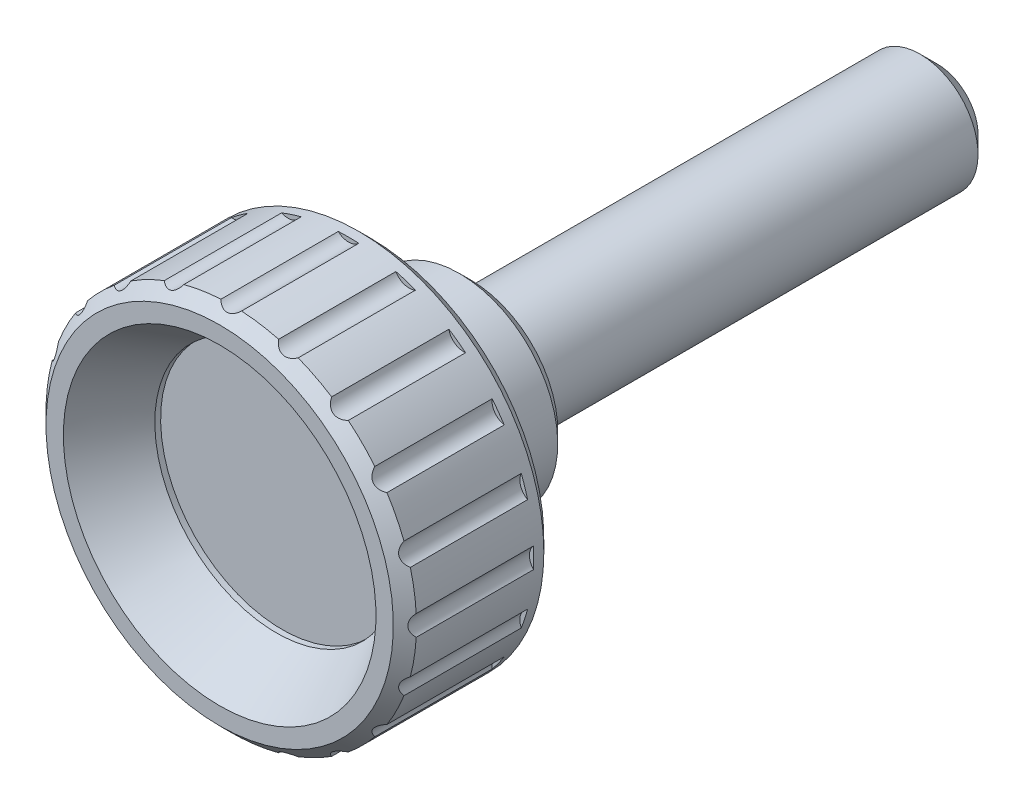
ISO-10303-21;
HEADER;
FILE_DESCRIPTION(('STEP AP214'),'2;1');
FILE_NAME('part.step','',(''),(''),'','','');
FILE_SCHEMA(('AUTOMOTIVE_DESIGN { 1 0 10303 214 1 1 1 1 }'));
ENDSEC;
DATA;
#1=APPLICATION_CONTEXT('core data for automotive mechanical design processes');
#2=APPLICATION_PROTOCOL_DEFINITION('international standard','automotive_design',2000,#1);
#3=PRODUCT_CONTEXT('',#1,'mechanical');
#4=PRODUCT('Part','Part','',(#3));
#5=PRODUCT_RELATED_PRODUCT_CATEGORY('part','',(#4));
#6=PRODUCT_DEFINITION_FORMATION('','',#4);
#7=PRODUCT_DEFINITION_CONTEXT('part definition',#1,'design');
#8=PRODUCT_DEFINITION('design','',#6,#7);
#9=PRODUCT_DEFINITION_SHAPE('','',#8);
#10=(LENGTH_UNIT() NAMED_UNIT(*) SI_UNIT(.MILLI.,.METRE.));
#11=(NAMED_UNIT(*) PLANE_ANGLE_UNIT() SI_UNIT($,.RADIAN.));
#12=(NAMED_UNIT(*) SI_UNIT($,.STERADIAN.) SOLID_ANGLE_UNIT());
#13=UNCERTAINTY_MEASURE_WITH_UNIT(LENGTH_MEASURE(1.E-05),#10,'distance_accuracy_value','');
#14=(GEOMETRIC_REPRESENTATION_CONTEXT(3) GLOBAL_UNCERTAINTY_ASSIGNED_CONTEXT((#13)) GLOBAL_UNIT_ASSIGNED_CONTEXT((#10,
#11,#12)) REPRESENTATION_CONTEXT('',''));
#15=CARTESIAN_POINT('',(0.,0.,0.));
#16=DIRECTION('',(0.,0.,1.));
#17=DIRECTION('',(1.,0.,0.));
#18=AXIS2_PLACEMENT_3D('',#15,#16,#17);
#19=CARTESIAN_POINT('',(7.5,1.06600726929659E-13,0.300000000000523));
#20=DIRECTION('',(0.,-3.55335756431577E-13,-1.));
#21=DIRECTION('',(0.,1.,-3.55335756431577E-13));
#22=AXIS2_PLACEMENT_3D('',#19,#20,#21);
#23=PLANE('',#22);
#24=CARTESIAN_POINT('',(0.,1.06600726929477E-13,0.300000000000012));
#25=DIRECTION('',(0.,-3.55335756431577E-13,-1.));
#26=DIRECTION('',(0.,1.,-3.55335756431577E-13));
#27=AXIS2_PLACEMENT_3D('',#24,#25,#26);
#28=CIRCLE('',#27,7.5);
#29=CARTESIAN_POINT('',(0.,7.50000000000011,0.299999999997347));
#30=VERTEX_POINT('',#29);
#31=EDGE_CURVE('E1107',#30,#30,#28,.T.);
#32=ORIENTED_EDGE('',*,*,#31,.T.);
#33=EDGE_LOOP('',(#32));
#34=FACE_BOUND('',#33,.T.);
#35=CARTESIAN_POINT('',(0.,1.06600726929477E-13,0.300000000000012));
#36=DIRECTION('',(0.,-3.55335756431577E-13,-1.));
#37=DIRECTION('',(0.,1.,-3.55335756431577E-13));
#38=AXIS2_PLACEMENT_3D('',#35,#36,#37);
#39=CIRCLE('',#38,6.);
#40=CARTESIAN_POINT('',(0.,6.00000000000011,0.29999999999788));
#41=VERTEX_POINT('',#40);
#42=EDGE_CURVE('E1321',#41,#41,#39,.T.);
#43=ORIENTED_EDGE('',*,*,#42,.F.);
#44=EDGE_LOOP('',(#43));
#45=FACE_BOUND('',#44,.T.);
#46=ADVANCED_FACE('F14',(#34,#45),#23,.T.);
#47=CARTESIAN_POINT('',(-1.43127530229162E-12,7.46205088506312E-12,21.));
#48=DIRECTION('',(0.,-3.55335756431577E-13,-1.));
#49=DIRECTION('',(0.,1.,-3.55335756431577E-13));
#50=AXIS2_PLACEMENT_3D('',#47,#48,#49);
#51=CONICAL_SURFACE('',#50,16.,0.785398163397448);
#52=CARTESIAN_POINT('',(-1.49943126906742E-12,7.81738664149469E-12,22.));
#53=DIRECTION('',(0.,-3.55335756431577E-13,-1.));
#54=DIRECTION('',(0.,1.,-3.55335756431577E-13));
#55=AXIS2_PLACEMENT_3D('',#52,#53,#54);
#56=CIRCLE('',#55,15.);
#57=CARTESIAN_POINT('',(-1.49943126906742E-12,15.0000000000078,21.9999999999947));
#58=VERTEX_POINT('',#57);
#59=EDGE_CURVE('E580',#58,#58,#56,.T.);
#60=ORIENTED_EDGE('',*,*,#59,.T.);
#61=EDGE_LOOP('',(#60));
#62=FACE_BOUND('',#61,.T.);
#63=CARTESIAN_POINT('',(-1.43127530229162E-12,7.46205088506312E-12,21.));
#64=DIRECTION('',(0.,-3.55335756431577E-13,-1.));
#65=DIRECTION('',(0.,1.,-3.55335756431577E-13));
#66=AXIS2_PLACEMENT_3D('',#63,#64,#65);
#67=CIRCLE('',#66,16.);
#68=CARTESIAN_POINT('',(15.9753508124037,-0.887787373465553,21.0000000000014));
#69=VERTEX_POINT('',#68);
#70=CARTESIAN_POINT('',(15.4678028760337,-4.09231892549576,21.0000000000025));
#71=VERTEX_POINT('',#70);
#72=EDGE_CURVE('E585',#69,#71,#67,.T.);
#73=ORIENTED_EDGE('',*,*,#72,.F.);
#74=CARTESIAN_POINT('',(15.9755398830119,-0.887989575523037,20.9998000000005));
#75=CARTESIAN_POINT('',(15.9351784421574,-0.844826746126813,21.0424866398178));
#76=CARTESIAN_POINT('',(15.8966188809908,-0.797693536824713,21.0834537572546));
#77=CARTESIAN_POINT('',(15.8245769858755,-0.695019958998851,21.1602482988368));
#78=CARTESIAN_POINT('',(15.791150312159,-0.639398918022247,21.1960191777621));
#79=CARTESIAN_POINT('',(15.7380490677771,-0.532816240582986,21.2530008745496));
#80=CARTESIAN_POINT('',(15.7169614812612,-0.48337112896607,21.275690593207));
#81=CARTESIAN_POINT('',(15.6806455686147,-0.380207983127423,21.3148283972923));
#82=CARTESIAN_POINT('',(15.6653967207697,-0.326505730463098,21.3312983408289));
#83=CARTESIAN_POINT('',(15.6416857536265,-0.215315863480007,21.3569309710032));
#84=CARTESIAN_POINT('',(15.6332906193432,-0.157796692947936,21.366021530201));
#85=CARTESIAN_POINT('',(15.6243518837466,-0.0414082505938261,21.3757012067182));
#86=CARTESIAN_POINT('',(15.623808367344,0.0174610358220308,21.3762902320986));
#87=CARTESIAN_POINT('',(15.6301546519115,0.12624587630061,21.3694172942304));
#88=CARTESIAN_POINT('',(15.6360489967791,0.176295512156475,21.3630334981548));
#89=CARTESIAN_POINT('',(15.6532896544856,0.274274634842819,21.344383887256));
#90=CARTESIAN_POINT('',(15.6646343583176,0.322204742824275,21.33211980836));
#91=CARTESIAN_POINT('',(15.6925197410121,0.416525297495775,21.3020256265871));
#92=CARTESIAN_POINT('',(15.709218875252,0.462813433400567,21.2840259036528));
#93=CARTESIAN_POINT('',(15.7468524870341,0.551635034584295,21.2435491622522));
#94=CARTESIAN_POINT('',(15.7677958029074,0.594160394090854,21.2210628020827));
#95=CARTESIAN_POINT('',(15.8173070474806,0.682678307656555,21.168037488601));
#96=CARTESIAN_POINT('',(15.846568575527,0.727842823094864,21.1367787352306));
#97=CARTESIAN_POINT('',(15.9086393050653,0.812237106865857,21.0706895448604));
#98=CARTESIAN_POINT('',(15.9414255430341,0.851501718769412,21.0358822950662));
#99=CARTESIAN_POINT('',(15.9755398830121,0.887989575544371,20.9998));
#100=B_SPLINE_CURVE_WITH_KNOTS('',3,(#74,#75,#76,#77,#78,#79,#80,#81,#82,#83,#84,#85,#86,#87,
#88,#89,#90,#91,#92,#93,#94,#95,#96,#97,#98,#99),.UNSPECIFIED.,.F.,.F.,(4,2,2,2,2,2,2,2,2,2,2,2,
4),(0.,0.219100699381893,0.440431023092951,0.61478688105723,0.7885241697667,0.96393981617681,
1.13935735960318,1.29104866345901,1.44269521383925,1.59932369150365,1.75628175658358,
1.94245598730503,2.12748340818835),.UNSPECIFIED.);
#101=CARTESIAN_POINT('',(15.9753508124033,0.887787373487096,21.0000000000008));
#102=VERTEX_POINT('',#101);
#103=EDGE_CURVE('E586',#69,#102,#100,.T.);
#104=ORIENTED_EDGE('',*,*,#103,.T.);
#105=CARTESIAN_POINT('',(15.467802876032,4.09231892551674,20.9999999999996));
#106=VERTEX_POINT('',#105);
#107=EDGE_CURVE('E589',#106,#102,#67,.T.);
#108=ORIENTED_EDGE('',*,*,#107,.F.);
#109=CARTESIAN_POINT('',(15.4680028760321,4.09220841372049,20.9998349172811));
#110=CARTESIAN_POINT('',(15.4162815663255,4.12078731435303,21.0425185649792));
#111=CARTESIAN_POINT('',(15.3650471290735,4.15369881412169,21.0834826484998));
#112=CARTESIAN_POINT('',(15.2648091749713,4.22908574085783,21.1602711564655));
#113=CARTESIAN_POINT('',(15.2158336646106,4.27165508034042,21.1960390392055));
#114=CARTESIAN_POINT('',(15.1323998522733,4.35661227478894,21.2530163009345));
#115=CARTESIAN_POINT('',(15.0970664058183,4.39712151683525,21.2757043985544));
#116=CARTESIAN_POINT('',(15.030651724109,4.48401408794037,21.3148389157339));
#117=CARTESIAN_POINT('',(14.9995558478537,4.530376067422,21.3313071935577));
#118=CARTESIAN_POINT('',(14.9426490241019,4.62879687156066,21.3569365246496));
#119=CARTESIAN_POINT('',(14.9168920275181,4.68090639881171,21.3660254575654));
#120=CARTESIAN_POINT('',(14.8724279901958,4.78883525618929,21.3757021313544));
#121=CARTESIAN_POINT('',(14.8537210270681,4.84465462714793,21.3762897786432));
#122=CARTESIAN_POINT('',(14.8261428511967,4.95007522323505,21.3694146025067));
#123=CARTESIAN_POINT('',(14.8162835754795,4.9994964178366,21.363029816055));
#124=CARTESIAN_POINT('',(14.8024051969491,5.09800697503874,21.3443784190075));
#125=CARTESIAN_POINT('',(14.7983843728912,5.14709643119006,21.3321135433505));
#126=CARTESIAN_POINT('',(14.7957600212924,5.2454174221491,21.302017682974));
#127=CARTESIAN_POINT('',(14.7973389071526,5.29460058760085,21.2840169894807));
#128=CARTESIAN_POINT('',(14.8056849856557,5.39070462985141,21.243538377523));
#129=CARTESIAN_POINT('',(14.8124630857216,5.43762052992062,21.2210511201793));
#130=CARTESIAN_POINT('',(14.8321965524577,5.53709129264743,21.1680316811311));
#131=CARTESIAN_POINT('',(14.8460657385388,5.58907402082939,21.1367810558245));
#132=CARTESIAN_POINT('',(14.8790094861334,5.6884938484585,21.0707098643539));
#133=CARTESIAN_POINT('',(14.8980514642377,5.73595697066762,21.0359124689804));
#134=CARTESIAN_POINT('',(14.9192136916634,5.78119085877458,20.9998404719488));
#135=B_SPLINE_CURVE_WITH_KNOTS('',3,(#109,#110,#111,#112,#113,#114,#115,#116,#117,#118,#119,
#120,#121,#122,#123,#124,#125,#126,#127,#128,#129,#130,#131,#132,#133,#134),.UNSPECIFIED.,.F.,
.F.,(4,2,2,2,2,2,2,2,2,2,2,2,4),(0.,0.219090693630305,0.440410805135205,0.614763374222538,
0.788497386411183,0.963909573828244,1.13932369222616,1.29101393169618,1.44265944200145,
1.59928961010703,1.75624927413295,1.94237523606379,2.12735493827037),.UNSPECIFIED.);
#136=CARTESIAN_POINT('',(14.9191201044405,5.78099085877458,20.9999999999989));
#137=VERTEX_POINT('',#136);
#138=EDGE_CURVE('E276',#106,#137,#135,.T.);
#139=ORIENTED_EDGE('',*,*,#138,.T.);
#140=CARTESIAN_POINT('',(13.4461586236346,8.67184053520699,20.9999999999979));
#141=VERTEX_POINT('',#140);
#142=EDGE_CURVE('E592',#141,#137,#67,.T.);
#143=ORIENTED_EDGE('',*,*,#142,.F.);
#144=CARTESIAN_POINT('',(13.4463586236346,8.6718019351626,20.9998528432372));
#145=CARTESIAN_POINT('',(13.3883385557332,8.68300023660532,21.0425349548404));
#146=CARTESIAN_POINT('',(13.329442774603,8.69846942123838,21.0834974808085));
#147=CARTESIAN_POINT('',(13.2108177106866,8.73919269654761,21.1602828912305));
#148=CARTESIAN_POINT('',(13.151086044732,8.76454475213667,21.1960492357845));
#149=CARTESIAN_POINT('',(13.045484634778,8.81956217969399,21.2530242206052));
#150=CARTESIAN_POINT('',(12.9993630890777,8.84717062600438,21.275711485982));
#151=CARTESIAN_POINT('',(12.9093490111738,8.90928797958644,21.3148443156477));
#152=CARTESIAN_POINT('',(12.865449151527,8.94377205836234,21.3313117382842));
#153=CARTESIAN_POINT('',(12.7809154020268,9.0197911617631,21.3569393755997));
#154=CARTESIAN_POINT('',(12.7403171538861,9.06139107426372,21.3660274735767));
#155=CARTESIAN_POINT('',(12.6646792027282,9.15029744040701,21.3757026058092));
#156=CARTESIAN_POINT('',(12.6296395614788,9.19760395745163,21.3762895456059));
#157=CARTESIAN_POINT('',(12.5708357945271,9.28934266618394,21.3694132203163));
#158=CARTESIAN_POINT('',(12.5461876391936,9.33329835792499,21.3630279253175));
#159=CARTESIAN_POINT('',(12.5025481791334,9.42269874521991,21.3443756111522));
#160=CARTESIAN_POINT('',(12.4835552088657,9.46814299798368,21.3321103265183));
#161=CARTESIAN_POINT('',(12.4506773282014,9.56084100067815,21.3020136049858));
#162=CARTESIAN_POINT('',(12.4369809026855,9.6081051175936,21.2840124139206));
#163=CARTESIAN_POINT('',(12.4152215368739,9.70208497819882,21.2435328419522));
#164=CARTESIAN_POINT('',(12.4071705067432,9.7487993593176,21.2210451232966));
#165=CARTESIAN_POINT('',(12.3952016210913,9.84949409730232,21.168027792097));
#166=CARTESIAN_POINT('',(12.3923288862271,9.9032128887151,21.1367802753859));
#167=CARTESIAN_POINT('',(12.3929374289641,10.0079364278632,21.0707160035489));
#168=CARTESIAN_POINT('',(12.3963796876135,10.0589558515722,21.0359224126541));
#169=CARTESIAN_POINT('',(12.4025267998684,10.1085106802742,20.9998544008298));
#170=B_SPLINE_CURVE_WITH_KNOTS('',3,(#144,#145,#146,#147,#148,#149,#150,#151,#152,#153,#154,
#155,#156,#157,#158,#159,#160,#161,#162,#163,#164,#165,#166,#167,#168,#169),.UNSPECIFIED.,.F.,
.F.,(4,2,2,2,2,2,2,2,2,2,2,2,4),(0.,0.21908555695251,0.440400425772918,0.61475130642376,
0.788483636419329,0.963894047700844,1.1393064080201,1.29099610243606,1.4426410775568,
1.59927210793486,1.75623259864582,1.94233964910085,2.12730065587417),.UNSPECIFIED.);
#171=CARTESIAN_POINT('',(12.4025019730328,10.1083106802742,20.9999999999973));
#172=VERTEX_POINT('',#171);
#173=EDGE_CURVE('E519',#141,#172,#170,.T.);
#174=ORIENTED_EDGE('',*,*,#173,.T.);
#175=CARTESIAN_POINT('',(10.1083106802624,12.4025019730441,20.9999999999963));
#176=VERTEX_POINT('',#175);
#177=EDGE_CURVE('E1289',#176,#172,#67,.T.);
#178=ORIENTED_EDGE('',*,*,#177,.F.);
#179=CARTESIAN_POINT('',(10.1085106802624,12.4025267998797,20.9998544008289));
#180=CARTESIAN_POINT('',(10.0498699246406,12.3952479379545,21.042536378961));
#181=CARTESIAN_POINT('',(9.9890765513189,12.3917603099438,21.0834987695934));
#182=CARTESIAN_POINT('',(9.86367341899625,12.3938334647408,21.1602839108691));
#183=CARTESIAN_POINT('',(9.79903112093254,12.3994866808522,21.1960501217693));
#184=CARTESIAN_POINT('',(9.68159704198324,12.4191788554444,21.2530249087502));
#185=CARTESIAN_POINT('',(9.62920140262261,12.4311837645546,21.2757121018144));
#186=CARTESIAN_POINT('',(9.52439769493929,12.4624451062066,21.3148447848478));
#187=CARTESIAN_POINT('',(9.47199033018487,12.4816756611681,21.3313121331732));
#188=CARTESIAN_POINT('',(9.36810287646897,12.527851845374,21.3569396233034));
#189=CARTESIAN_POINT('',(9.31663663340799,12.5548702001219,21.3660276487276));
#190=CARTESIAN_POINT('',(9.21722722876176,12.6160518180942,21.3757026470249));
#191=CARTESIAN_POINT('',(9.16928410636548,12.6502151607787,21.3762895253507));
#192=CARTESIAN_POINT('',(9.08500969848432,12.7192925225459,21.3694131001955));
#193=CARTESIAN_POINT('',(9.04798489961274,12.7534801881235,21.3630277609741));
#194=CARTESIAN_POINT('',(8.97885516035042,12.825019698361,21.3443753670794));
#195=CARTESIAN_POINT('',(8.94674877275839,12.8623706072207,21.3321100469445));
#196=CARTESIAN_POINT('',(8.8868348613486,12.9403718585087,21.3020132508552));
#197=CARTESIAN_POINT('',(8.85920339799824,12.9810903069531,21.2840120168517));
#198=CARTESIAN_POINT('',(8.80946769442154,13.0637465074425,21.243532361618));
#199=CARTESIAN_POINT('',(8.78737520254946,13.1056866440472,21.2210446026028));
#200=CARTESIAN_POINT('',(8.74487571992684,13.1977546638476,21.1680270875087));
#201=CARTESIAN_POINT('',(8.72554355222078,13.247956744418,21.1367794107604));
#202=CARTESIAN_POINT('',(8.69376097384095,13.3477431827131,21.0707148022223));
#203=CARTESIAN_POINT('',(8.68126891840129,13.3973294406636,21.0359210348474));
#204=CARTESIAN_POINT('',(8.67180193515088,13.4463586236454,20.9998528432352));
#205=B_SPLINE_CURVE_WITH_KNOTS('',3,(#179,#180,#181,#182,#183,#184,#185,#186,#187,#188,#189,
#190,#191,#192,#193,#194,#195,#196,#197,#198,#199,#200,#201,#202,#203,#204),.UNSPECIFIED.,.F.,
.F.,(4,2,2,2,2,2,2,2,2,2,2,2,4),(0.,0.219085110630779,0.440399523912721,0.614750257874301,
0.788482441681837,0.963892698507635,1.13930490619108,1.29099455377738,1.44263948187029,
1.599270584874,1.75623114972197,1.94233892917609,2.12730065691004),.UNSPECIFIED.);
#206=CARTESIAN_POINT('',(8.67184053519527,13.4461586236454,20.9999999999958));
#207=VERTEX_POINT('',#206);
#208=EDGE_CURVE('E1279',#176,#207,#205,.T.);
#209=ORIENTED_EDGE('',*,*,#208,.T.);
#210=CARTESIAN_POINT('',(5.78099085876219,14.9191201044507,20.9999999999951));
#211=VERTEX_POINT('',#210);
#212=EDGE_CURVE('E599',#211,#207,#67,.T.);
#213=ORIENTED_EDGE('',*,*,#212,.F.);
#214=CARTESIAN_POINT('',(5.78119085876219,14.9192136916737,20.9998404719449));
#215=CARTESIAN_POINT('',(5.72766915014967,14.8941689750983,21.0425236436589));
#216=CARTESIAN_POINT('',(5.67092851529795,14.872064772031,21.0834872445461));
#217=CARTESIAN_POINT('',(5.5510212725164,14.8352827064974,21.1602747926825));
#218=CARTESIAN_POINT('',(5.48779515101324,14.8206827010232,21.1960421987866));
#219=CARTESIAN_POINT('',(5.37002254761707,14.8031204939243,21.2530187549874));
#220=CARTESIAN_POINT('',(5.31648146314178,14.7983461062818,21.2757065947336));
#221=CARTESIAN_POINT('',(5.20714649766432,14.7956901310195,21.3148405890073));
#222=CARTESIAN_POINT('',(5.15136128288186,14.7977841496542,21.3313086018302));
#223=CARTESIAN_POINT('',(5.03828848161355,14.8095962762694,21.3569374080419));
#224=CARTESIAN_POINT('',(4.98099158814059,14.8193878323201,21.3660260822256));
#225=CARTESIAN_POINT('',(4.86754042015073,14.8468549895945,21.3757022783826));
#226=CARTESIAN_POINT('',(4.81138615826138,14.8645306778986,21.3762897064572));
#227=CARTESIAN_POINT('',(4.7098894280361,14.9041843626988,21.3694141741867));
#228=CARTESIAN_POINT('',(4.66411184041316,14.9252571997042,21.3630292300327));
#229=CARTESIAN_POINT('',(4.5762579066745,14.971932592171,21.344377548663));
#230=CARTESIAN_POINT('',(4.53418047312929,14.9975338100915,21.3321125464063));
#231=CARTESIAN_POINT('',(4.45309476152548,15.0532024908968,21.3020164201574));
#232=CARTESIAN_POINT('',(4.41423284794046,15.0833891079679,21.2840155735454));
#233=CARTESIAN_POINT('',(4.3413888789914,15.1466300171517,21.2435366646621));
#234=CARTESIAN_POINT('',(4.30741726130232,15.1796902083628,21.2210492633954));
#235=CARTESIAN_POINT('',(4.2385424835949,15.2541231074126,21.1680291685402));
#236=CARTESIAN_POINT('',(4.20463940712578,15.2958988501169,21.136777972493));
#237=CARTESIAN_POINT('',(4.1435705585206,15.3809897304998,21.0707055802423));
#238=CARTESIAN_POINT('',(4.11636458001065,15.4242938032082,21.0359075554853));
#239=CARTESIAN_POINT('',(4.09220841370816,15.4680028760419,20.9998349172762));
#240=B_SPLINE_CURVE_WITH_KNOTS('',3,(#214,#215,#216,#217,#218,#219,#220,#221,#222,#223,#224,
#225,#226,#227,#228,#229,#230,#231,#232,#233,#234,#235,#236,#237,#238,#239),.UNSPECIFIED.,.F.,
.F.,(4,2,2,2,2,2,2,2,2,2,2,2,4),(0.,0.21908910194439,0.440407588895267,0.614759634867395,
0.78849312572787,0.963904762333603,1.13931833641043,1.29100840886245,1.44265375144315,
1.59928417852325,1.7562441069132,1.9423726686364,2.12735494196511),.UNSPECIFIED.);
#241=CARTESIAN_POINT('',(4.09231892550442,15.4678028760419,20.9999999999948));
#242=VERTEX_POINT('',#241);
#243=EDGE_CURVE('E1271',#211,#242,#240,.T.);
#244=ORIENTED_EDGE('',*,*,#243,.T.);
#245=CARTESIAN_POINT('',(0.887787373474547,15.9753508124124,20.9999999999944));
#246=VERTEX_POINT('',#245);
#247=EDGE_CURVE('E595',#246,#242,#67,.T.);
#248=ORIENTED_EDGE('',*,*,#247,.F.);
#249=CARTESIAN_POINT('',(0.887987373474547,15.9755378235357,20.9998021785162));
#250=CARTESIAN_POINT('',(0.844824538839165,15.9351765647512,21.0424886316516));
#251=CARTESIAN_POINT('',(0.797691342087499,15.8966171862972,21.0834555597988));
#252=CARTESIAN_POINT('',(0.695017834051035,15.8245756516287,21.1602497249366));
#253=CARTESIAN_POINT('',(0.639396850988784,15.7911491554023,21.1960204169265));
#254=CARTESIAN_POINT('',(0.532814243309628,15.7380481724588,21.2530018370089));
#255=CARTESIAN_POINT('',(0.483369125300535,15.716960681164,21.2756914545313));
#256=CARTESIAN_POINT('',(0.380205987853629,15.6806449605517,21.3148290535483));
#257=CARTESIAN_POINT('',(0.326503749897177,15.665396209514,21.3312988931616));
#258=CARTESIAN_POINT('',(0.215313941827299,15.6416854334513,21.3569313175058));
#259=CARTESIAN_POINT('',(0.157794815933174,15.6332903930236,21.3660217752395));
#260=CARTESIAN_POINT('',(0.0414064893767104,15.6243518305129,21.3757012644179));
#261=CARTESIAN_POINT('',(-0.0174627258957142,15.6238083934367,21.3762902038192));
#262=CARTESIAN_POINT('',(-0.1262474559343,15.6301548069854,21.3694171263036));
#263=CARTESIAN_POINT('',(-0.176297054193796,15.6360492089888,21.3630332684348));
#264=CARTESIAN_POINT('',(-0.274276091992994,15.6532899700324,21.3443835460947));
#265=CARTESIAN_POINT('',(-0.322206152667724,15.664634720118,21.332119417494));
#266=CARTESIAN_POINT('',(-0.416526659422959,15.6925202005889,21.3020251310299));
#267=CARTESIAN_POINT('',(-0.462814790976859,15.7092193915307,21.2840253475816));
#268=CARTESIAN_POINT('',(-0.551636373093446,15.7468531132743,21.2435484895));
#269=CARTESIAN_POINT('',(-0.594161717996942,15.7677964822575,21.2210620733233));
#270=CARTESIAN_POINT('',(-0.682678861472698,15.8173074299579,21.1680370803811));
#271=CARTESIAN_POINT('',(-0.72784270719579,15.8465685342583,21.1367787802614));
#272=CARTESIAN_POINT('',(-0.812235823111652,15.9086383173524,21.0706905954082));
#273=CARTESIAN_POINT('',(-0.851499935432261,15.9414240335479,21.0358838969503));
#274=CARTESIAN_POINT('',(-0.887987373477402,15.9755378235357,20.999802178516));
#275=B_SPLINE_CURVE_WITH_KNOTS('',3,(#249,#250,#251,#252,#253,#254,#255,#256,#257,#258,#259,
#260,#261,#262,#263,#264,#265,#266,#267,#268,#269,#270,#271,#272,#273,#274),.UNSPECIFIED.,.F.,
.F.,(4,2,2,2,2,2,2,2,2,2,2,2,4),(0.,0.219100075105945,0.440429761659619,0.614785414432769,
0.788522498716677,0.963937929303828,1.13935525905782,1.29104649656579,1.44269298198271,
1.59932156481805,1.75627972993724,1.94245124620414,2.12747598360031),.UNSPECIFIED.);
#276=CARTESIAN_POINT('',(-0.887787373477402,15.9753508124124,20.9999999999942));
#277=VERTEX_POINT('',#276);
#278=EDGE_CURVE('E1264',#246,#277,#275,.T.);
#279=ORIENTED_EDGE('',*,*,#278,.T.);
#280=CARTESIAN_POINT('',(-4.09231892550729,15.4678028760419,20.9999999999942));
#281=VERTEX_POINT('',#280);
#282=EDGE_CURVE('E600',#281,#277,#67,.T.);
#283=ORIENTED_EDGE('',*,*,#282,.F.);
#284=CARTESIAN_POINT('',(-4.09220841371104,15.4680028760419,20.9998349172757));
#285=CARTESIAN_POINT('',(-4.12078731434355,15.4162815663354,21.0425185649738));
#286=CARTESIAN_POINT('',(-4.15369881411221,15.3650471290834,21.0834826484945));
#287=CARTESIAN_POINT('',(-4.22908574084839,15.2648091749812,21.1602711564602));
#288=CARTESIAN_POINT('',(-4.271655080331,15.2158336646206,21.1960390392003));
#289=CARTESIAN_POINT('',(-4.35661227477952,15.1323998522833,21.2530163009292));
#290=CARTESIAN_POINT('',(-4.39712151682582,15.0970664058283,21.2757043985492));
#291=CARTESIAN_POINT('',(-4.48401408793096,15.0306517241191,21.3148389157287));
#292=CARTESIAN_POINT('',(-4.53037606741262,14.9995558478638,21.3313071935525));
#293=CARTESIAN_POINT('',(-4.6287968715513,14.942649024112,21.3569365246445));
#294=CARTESIAN_POINT('',(-4.68090639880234,14.9168920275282,21.3660254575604));
#295=CARTESIAN_POINT('',(-4.78883525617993,14.872427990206,21.3757021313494));
#296=CARTESIAN_POINT('',(-4.84465462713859,14.8537210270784,21.3762897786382));
#297=CARTESIAN_POINT('',(-4.95007522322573,14.826142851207,21.3694146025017));
#298=CARTESIAN_POINT('',(-4.99949641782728,14.8162835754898,21.3630298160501));
#299=CARTESIAN_POINT('',(-5.09800697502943,14.8024051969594,21.3443784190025));
#300=CARTESIAN_POINT('',(-5.14709643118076,14.7983843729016,21.3321135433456));
#301=CARTESIAN_POINT('',(-5.24541742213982,14.7957600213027,21.3020176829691));
#302=CARTESIAN_POINT('',(-5.29460058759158,14.797338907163,21.2840169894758));
#303=CARTESIAN_POINT('',(-5.39070462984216,14.805684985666,21.2435383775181));
#304=CARTESIAN_POINT('',(-5.43762052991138,14.8124630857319,21.2210511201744));
#305=CARTESIAN_POINT('',(-5.53709129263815,14.832196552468,21.1680316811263));
#306=CARTESIAN_POINT('',(-5.58907402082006,14.8460657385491,21.1367810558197));
#307=CARTESIAN_POINT('',(-5.68849384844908,14.8790094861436,21.0707098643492));
#308=CARTESIAN_POINT('',(-5.73595697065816,14.8980514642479,21.0359124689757));
#309=CARTESIAN_POINT('',(-5.78119085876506,14.9192136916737,20.9998404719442));
#310=B_SPLINE_CURVE_WITH_KNOTS('',3,(#284,#285,#286,#287,#288,#289,#290,#291,#292,#293,#294,
#295,#296,#297,#298,#299,#300,#301,#302,#303,#304,#305,#306,#307,#308,#309),.UNSPECIFIED.,.F.,
.F.,(4,2,2,2,2,2,2,2,2,2,2,2,4),(0.,0.219090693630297,0.440410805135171,0.614763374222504,
0.788497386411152,0.96390957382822,1.13932369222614,1.29101393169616,1.44265944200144,
1.59928961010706,1.75624927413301,1.94237523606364,2.12735493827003),.UNSPECIFIED.);
#311=CARTESIAN_POINT('',(-5.78099085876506,14.9191201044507,20.9999999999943));
#312=VERTEX_POINT('',#311);
#313=EDGE_CURVE('E1257',#281,#312,#310,.T.);
#314=ORIENTED_EDGE('',*,*,#313,.T.);
#315=CARTESIAN_POINT('',(-8.67184053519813,13.4461586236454,20.9999999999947));
#316=VERTEX_POINT('',#315);
#317=EDGE_CURVE('E1126',#316,#312,#67,.T.);
#318=ORIENTED_EDGE('',*,*,#317,.F.);
#319=CARTESIAN_POINT('',(-8.67180193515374,13.4463586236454,20.999852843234));
#320=CARTESIAN_POINT('',(-8.68300023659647,13.3883385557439,21.0425349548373));
#321=CARTESIAN_POINT('',(-8.69846942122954,13.3294427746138,21.0834974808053));
#322=CARTESIAN_POINT('',(-8.73919269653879,13.2108177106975,21.1602828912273));
#323=CARTESIAN_POINT('',(-8.76454475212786,13.1510860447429,21.1960492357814));
#324=CARTESIAN_POINT('',(-8.81956217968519,13.0454846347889,21.253024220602));
#325=CARTESIAN_POINT('',(-8.84717062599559,12.9993630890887,21.2757114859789));
#326=CARTESIAN_POINT('',(-8.90928797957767,12.9093490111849,21.3148443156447));
#327=CARTESIAN_POINT('',(-8.94377205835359,12.8654491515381,21.3313117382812));
#328=CARTESIAN_POINT('',(-9.01979116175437,12.780915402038,21.3569393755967));
#329=CARTESIAN_POINT('',(-9.06139107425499,12.7403171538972,21.3660274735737));
#330=CARTESIAN_POINT('',(-9.1502974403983,12.6646792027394,21.3757026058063));
#331=CARTESIAN_POINT('',(-9.19760395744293,12.62963956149,21.376289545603));
#332=CARTESIAN_POINT('',(-9.28934266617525,12.5708357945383,21.3694132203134));
#333=CARTESIAN_POINT('',(-9.3332983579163,12.5461876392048,21.3630279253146));
#334=CARTESIAN_POINT('',(-9.42269874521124,12.5025481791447,21.3443756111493));
#335=CARTESIAN_POINT('',(-9.46814299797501,12.483555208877,21.3321103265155));
#336=CARTESIAN_POINT('',(-9.56084100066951,12.4506773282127,21.302013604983));
#337=CARTESIAN_POINT('',(-9.60810511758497,12.4369809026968,21.2840124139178));
#338=CARTESIAN_POINT('',(-9.70208497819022,12.4152215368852,21.2435328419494));
#339=CARTESIAN_POINT('',(-9.74879935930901,12.4071705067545,21.2210451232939));
#340=CARTESIAN_POINT('',(-9.84949409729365,12.3952016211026,21.1680277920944));
#341=CARTESIAN_POINT('',(-9.90321288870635,12.3923288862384,21.1367802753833));
#342=CARTESIAN_POINT('',(-10.0079364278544,12.3929374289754,21.0707160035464));
#343=CARTESIAN_POINT('',(-10.0589558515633,12.3963796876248,21.0359224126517));
#344=CARTESIAN_POINT('',(-10.1085106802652,12.4025267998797,20.9998544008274));
#345=B_SPLINE_CURVE_WITH_KNOTS('',3,(#319,#320,#321,#322,#323,#324,#325,#326,#327,#328,#329,
#330,#331,#332,#333,#334,#335,#336,#337,#338,#339,#340,#341,#342,#343,#344),.UNSPECIFIED.,.F.,
.F.,(4,2,2,2,2,2,2,2,2,2,2,2,4),(0.,0.21908555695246,0.440400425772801,0.614751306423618,
0.78848363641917,0.96389404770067,1.13930640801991,1.29099610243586,1.4426410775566,
1.59927210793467,1.75623259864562,1.94233964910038,2.12730065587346),.UNSPECIFIED.);
#346=CARTESIAN_POINT('',(-10.1083106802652,12.4025019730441,20.9999999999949));
#347=VERTEX_POINT('',#346);
#348=EDGE_CURVE('E1250',#316,#347,#345,.T.);
#349=ORIENTED_EDGE('',*,*,#348,.T.);
#350=CARTESIAN_POINT('',(-12.402501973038,10.1083106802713,20.9999999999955));
#351=VERTEX_POINT('',#350);
#352=EDGE_CURVE('E1129',#351,#347,#67,.T.);
#353=ORIENTED_EDGE('',*,*,#352,.F.);
#354=CARTESIAN_POINT('',(-12.4025267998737,10.1085106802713,20.9998544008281));
#355=CARTESIAN_POINT('',(-12.3952479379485,10.0498699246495,21.0425363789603));
#356=CARTESIAN_POINT('',(-12.3917603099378,9.98907655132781,21.0834987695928));
#357=CARTESIAN_POINT('',(-12.3938334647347,9.86367341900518,21.1602839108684));
#358=CARTESIAN_POINT('',(-12.3994866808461,9.79903112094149,21.1960501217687));
#359=CARTESIAN_POINT('',(-12.4191788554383,9.6815970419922,21.2530249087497));
#360=CARTESIAN_POINT('',(-12.4311837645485,9.62920140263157,21.2757121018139));
#361=CARTESIAN_POINT('',(-12.4624451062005,9.52439769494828,21.3148447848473));
#362=CARTESIAN_POINT('',(-12.481675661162,9.47199033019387,21.3313121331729));
#363=CARTESIAN_POINT('',(-12.5278518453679,9.36810287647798,21.356939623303));
#364=CARTESIAN_POINT('',(-12.5548702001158,9.316636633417,21.3660276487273));
#365=CARTESIAN_POINT('',(-12.6160518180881,9.21722722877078,21.3757026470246));
#366=CARTESIAN_POINT('',(-12.6502151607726,9.1692841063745,21.3762895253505));
#367=CARTESIAN_POINT('',(-12.7192925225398,9.08500969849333,21.3694131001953));
#368=CARTESIAN_POINT('',(-12.7534801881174,9.04798489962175,21.363027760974));
#369=CARTESIAN_POINT('',(-12.8250196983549,8.97885516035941,21.3443753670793));
#370=CARTESIAN_POINT('',(-12.8623706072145,8.94674877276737,21.3321100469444));
#371=CARTESIAN_POINT('',(-12.9403718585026,8.88683486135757,21.3020132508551));
#372=CARTESIAN_POINT('',(-12.9810903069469,8.8592033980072,21.2840120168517));
#373=CARTESIAN_POINT('',(-13.0637465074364,8.8094676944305,21.243532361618));
#374=CARTESIAN_POINT('',(-13.1056866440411,8.78737520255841,21.2210446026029));
#375=CARTESIAN_POINT('',(-13.1977546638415,8.74487571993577,21.1680270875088));
#376=CARTESIAN_POINT('',(-13.247956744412,8.72554355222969,21.1367794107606));
#377=CARTESIAN_POINT('',(-13.347743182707,8.69376097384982,21.0707148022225));
#378=CARTESIAN_POINT('',(-13.3973294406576,8.68126891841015,21.0359210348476));
#379=CARTESIAN_POINT('',(-13.4463586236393,8.67180193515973,20.9998528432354));
#380=B_SPLINE_CURVE_WITH_KNOTS('',3,(#354,#355,#356,#357,#358,#359,#360,#361,#362,#363,#364,
#365,#366,#367,#368,#369,#370,#371,#372,#373,#374,#375,#376,#377,#378,#379),.UNSPECIFIED.,.F.,
.F.,(4,2,2,2,2,2,2,2,2,2,2,2,4),(0.,0.219085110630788,0.440399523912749,0.614750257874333,
0.788482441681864,0.963892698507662,1.13930490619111,1.29099455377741,1.44263948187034,
1.59927058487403,1.75623114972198,1.94233892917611,2.12730065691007),.UNSPECIFIED.);
#381=CARTESIAN_POINT('',(-13.4461586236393,8.67184053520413,20.999999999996));
#382=VERTEX_POINT('',#381);
#383=EDGE_CURVE('E1240',#351,#382,#380,.T.);
#384=ORIENTED_EDGE('',*,*,#383,.T.);
#385=CARTESIAN_POINT('',(-14.9191201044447,5.78099085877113,20.999999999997));
#386=VERTEX_POINT('',#385);
#387=EDGE_CURVE('E1132',#386,#382,#67,.T.);
#388=ORIENTED_EDGE('',*,*,#387,.F.);
#389=CARTESIAN_POINT('',(-14.9192136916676,5.78119085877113,20.9998404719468));
#390=CARTESIAN_POINT('',(-14.8941689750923,5.7276691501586,21.0425236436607));
#391=CARTESIAN_POINT('',(-14.8720647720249,5.6709285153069,21.0834872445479));
#392=CARTESIAN_POINT('',(-14.8352827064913,5.5510212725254,21.1602747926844));
#393=CARTESIAN_POINT('',(-14.8206827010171,5.48779515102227,21.1960421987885));
#394=CARTESIAN_POINT('',(-14.8031204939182,5.37002254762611,21.2530187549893));
#395=CARTESIAN_POINT('',(-14.7983461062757,5.31648146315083,21.2757065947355));
#396=CARTESIAN_POINT('',(-14.7956901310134,5.20714649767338,21.3148405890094));
#397=CARTESIAN_POINT('',(-14.797784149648,5.15136128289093,21.3313086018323));
#398=CARTESIAN_POINT('',(-14.8095962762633,5.03828848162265,21.356937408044));
#399=CARTESIAN_POINT('',(-14.819387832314,4.9809915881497,21.3660260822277));
#400=CARTESIAN_POINT('',(-14.8468549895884,4.86754042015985,21.3757022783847));
#401=CARTESIAN_POINT('',(-14.8645306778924,4.81138615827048,21.3762897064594));
#402=CARTESIAN_POINT('',(-14.9041843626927,4.70988942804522,21.369414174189));
#403=CARTESIAN_POINT('',(-14.9252571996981,4.66411184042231,21.363029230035));
#404=CARTESIAN_POINT('',(-14.9719325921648,4.57625790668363,21.3443775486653));
#405=CARTESIAN_POINT('',(-14.9975338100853,4.53418047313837,21.3321125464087));
#406=CARTESIAN_POINT('',(-15.0532024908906,4.45309476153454,21.3020164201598));
#407=CARTESIAN_POINT('',(-15.0833891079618,4.41423284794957,21.2840155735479));
#408=CARTESIAN_POINT('',(-15.1466300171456,4.3413888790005,21.2435366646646));
#409=CARTESIAN_POINT('',(-15.1796902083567,4.30741726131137,21.2210492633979));
#410=CARTESIAN_POINT('',(-15.2541231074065,4.2385424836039,21.1680291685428));
#411=CARTESIAN_POINT('',(-15.2958988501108,4.20463940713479,21.1367779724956));
#412=CARTESIAN_POINT('',(-15.3809897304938,4.14357055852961,21.0707055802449));
#413=CARTESIAN_POINT('',(-15.4242938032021,4.11636458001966,21.0359075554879));
#414=CARTESIAN_POINT('',(-15.4680028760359,4.0922084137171,20.9998349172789));
#415=B_SPLINE_CURVE_WITH_KNOTS('',3,(#389,#390,#391,#392,#393,#394,#395,#396,#397,#398,#399,
#400,#401,#402,#403,#404,#405,#406,#407,#408,#409,#410,#411,#412,#413,#414),.UNSPECIFIED.,.F.,
.F.,(4,2,2,2,2,2,2,2,2,2,2,2,4),(0.,0.219089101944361,0.440407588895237,0.614759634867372,
0.788493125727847,0.963904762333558,1.13931833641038,1.29100840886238,1.44265375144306,
1.59928417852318,1.75624410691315,1.94237266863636,2.12735494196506),.UNSPECIFIED.);
#416=CARTESIAN_POINT('',(-15.4678028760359,4.09231892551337,20.9999999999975));
#417=VERTEX_POINT('',#416);
#418=EDGE_CURVE('E1233',#386,#417,#415,.T.);
#419=ORIENTED_EDGE('',*,*,#418,.T.);
#420=CARTESIAN_POINT('',(-15.9753508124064,0.887787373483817,20.9999999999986));
#421=VERTEX_POINT('',#420);
#422=EDGE_CURVE('E1135',#421,#417,#67,.T.);
#423=ORIENTED_EDGE('',*,*,#422,.F.);
#424=CARTESIAN_POINT('',(-15.9755398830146,0.887989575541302,20.9997999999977));
#425=CARTESIAN_POINT('',(-15.9351784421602,0.84482674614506,21.042486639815));
#426=CARTESIAN_POINT('',(-15.8966188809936,0.797693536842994,21.0834537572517));
#427=CARTESIAN_POINT('',(-15.8245769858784,0.695019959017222,21.160248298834));
#428=CARTESIAN_POINT('',(-15.791150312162,0.639398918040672,21.1960191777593));
#429=CARTESIAN_POINT('',(-15.7380490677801,0.53281624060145,21.2530008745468));
#430=CARTESIAN_POINT('',(-15.7169614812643,0.483371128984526,21.2756905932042));
#431=CARTESIAN_POINT('',(-15.6806455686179,0.380207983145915,21.3148283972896));
#432=CARTESIAN_POINT('',(-15.6653967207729,0.326505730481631,21.3312983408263));
#433=CARTESIAN_POINT('',(-15.6416857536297,0.215315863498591,21.3569309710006));
#434=CARTESIAN_POINT('',(-15.6332906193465,0.157796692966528,21.3660215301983));
#435=CARTESIAN_POINT('',(-15.62435188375,0.0414082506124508,21.3757012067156));
#436=CARTESIAN_POINT('',(-15.6238083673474,-0.0174610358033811,21.376290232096));
#437=CARTESIAN_POINT('',(-15.6301546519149,-0.126245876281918,21.3694172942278));
#438=CARTESIAN_POINT('',(-15.6360489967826,-0.176295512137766,21.3630334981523));
#439=CARTESIAN_POINT('',(-15.6532896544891,-0.274274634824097,21.3443838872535));
#440=CARTESIAN_POINT('',(-15.6646343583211,-0.322204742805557,21.3321198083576));
#441=CARTESIAN_POINT('',(-15.6925197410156,-0.416525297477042,21.3020256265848));
#442=CARTESIAN_POINT('',(-15.7092188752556,-0.462813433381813,21.2840259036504));
#443=CARTESIAN_POINT('',(-15.7468524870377,-0.551635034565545,21.2435491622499));
#444=CARTESIAN_POINT('',(-15.767795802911,-0.594160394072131,21.2210628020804));
#445=CARTESIAN_POINT('',(-15.8173070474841,-0.682678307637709,21.1680374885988));
#446=CARTESIAN_POINT('',(-15.8465685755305,-0.727842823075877,21.1367787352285));
#447=CARTESIAN_POINT('',(-15.9086393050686,-0.812237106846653,21.0706895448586));
#448=CARTESIAN_POINT('',(-15.9414255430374,-0.851501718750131,21.0358822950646));
#449=CARTESIAN_POINT('',(-15.9755398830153,-0.887989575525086,20.9997999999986));
#450=B_SPLINE_CURVE_WITH_KNOTS('',3,(#424,#425,#426,#427,#428,#429,#430,#431,#432,#433,#434,
#435,#436,#437,#438,#439,#440,#441,#442,#443,#444,#445,#446,#447,#448,#449),.UNSPECIFIED.,.F.,
.F.,(4,2,2,2,2,2,2,2,2,2,2,2,4),(0.,0.219100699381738,0.440431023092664,0.614786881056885,
0.788524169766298,0.963939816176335,1.13935735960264,1.29104866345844,1.44269521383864,
1.59932369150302,1.75628175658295,1.94245598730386,2.12748340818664),.UNSPECIFIED.);
#451=CARTESIAN_POINT('',(-15.9753508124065,-0.887787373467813,20.9999999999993));
#452=VERTEX_POINT('',#451);
#453=EDGE_CURVE('E1226',#421,#452,#450,.T.);
#454=ORIENTED_EDGE('',*,*,#453,.T.);
#455=CARTESIAN_POINT('',(-15.467802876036,-4.09231892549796,21.0000000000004));
#456=VERTEX_POINT('',#455);
#457=EDGE_CURVE('E1138',#456,#452,#67,.T.);
#458=ORIENTED_EDGE('',*,*,#457,.F.);
#459=CARTESIAN_POINT('',(-15.468002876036,-4.09220841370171,20.9998349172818));
#460=CARTESIAN_POINT('',(-15.4162815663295,-4.12078731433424,21.04251856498));
#461=CARTESIAN_POINT('',(-15.3650471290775,-4.15369881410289,21.0834826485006));
#462=CARTESIAN_POINT('',(-15.2648091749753,-4.229085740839,21.1602711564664));
#463=CARTESIAN_POINT('',(-15.2158336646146,-4.27165508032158,21.1960390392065));
#464=CARTESIAN_POINT('',(-15.1323998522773,-4.35661227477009,21.2530163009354));
#465=CARTESIAN_POINT('',(-15.0970664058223,-4.39712151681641,21.2757043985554));
#466=CARTESIAN_POINT('',(-15.0306517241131,-4.48401408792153,21.314838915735));
#467=CARTESIAN_POINT('',(-14.9995558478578,-4.53037606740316,21.3313071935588));
#468=CARTESIAN_POINT('',(-14.942649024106,-4.62879687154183,21.3569365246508));
#469=CARTESIAN_POINT('',(-14.9168920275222,-4.68090639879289,21.3660254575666));
#470=CARTESIAN_POINT('',(-14.8724279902,-4.78883525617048,21.3757021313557));
#471=CARTESIAN_POINT('',(-14.8537210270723,-4.84465462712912,21.3762897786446));
#472=CARTESIAN_POINT('',(-14.8261428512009,-4.95007522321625,21.3694146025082));
#473=CARTESIAN_POINT('',(-14.8162835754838,-4.99949641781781,21.3630298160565));
#474=CARTESIAN_POINT('',(-14.8024051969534,-5.09800697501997,21.344378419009));
#475=CARTESIAN_POINT('',(-14.7983843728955,-5.14709643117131,21.332113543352));
#476=CARTESIAN_POINT('',(-14.7957600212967,-5.24541742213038,21.3020176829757));
#477=CARTESIAN_POINT('',(-14.797338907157,-5.29460058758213,21.2840169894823));
#478=CARTESIAN_POINT('',(-14.80568498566,-5.39070462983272,21.2435383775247));
#479=CARTESIAN_POINT('',(-14.8124630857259,-5.43762052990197,21.221051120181));
#480=CARTESIAN_POINT('',(-14.832196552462,-5.53709129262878,21.168031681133));
#481=CARTESIAN_POINT('',(-14.8460657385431,-5.5890740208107,21.1367810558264));
#482=CARTESIAN_POINT('',(-14.8790094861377,-5.68849384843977,21.0707098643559));
#483=CARTESIAN_POINT('',(-14.8980514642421,-5.73595697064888,21.0359124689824));
#484=CARTESIAN_POINT('',(-14.9192136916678,-5.78119085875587,20.9998404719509));
#485=B_SPLINE_CURVE_WITH_KNOTS('',3,(#459,#460,#461,#462,#463,#464,#465,#466,#467,#468,#469,
#470,#471,#472,#473,#474,#475,#476,#477,#478,#479,#480,#481,#482,#483,#484),.UNSPECIFIED.,.F.,
.F.,(4,2,2,2,2,2,2,2,2,2,2,2,4),(0.,0.219090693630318,0.440410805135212,0.614763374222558,
0.788497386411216,0.96390957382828,1.1393236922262,1.29101393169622,1.4426594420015,
1.5992896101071,1.75624927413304,1.94237523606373,2.12735493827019),.UNSPECIFIED.);
#486=CARTESIAN_POINT('',(-14.9191201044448,-5.78099085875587,21.0000000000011));
#487=VERTEX_POINT('',#486);
#488=EDGE_CURVE('E1219',#456,#487,#485,.T.);
#489=ORIENTED_EDGE('',*,*,#488,.T.);
#490=CARTESIAN_POINT('',(-13.4461586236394,-8.6718405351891,21.0000000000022));
#491=VERTEX_POINT('',#490);
#492=EDGE_CURVE('E1141',#491,#487,#67,.T.);
#493=ORIENTED_EDGE('',*,*,#492,.F.);
#494=CARTESIAN_POINT('',(-13.4463586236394,-8.67180193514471,20.9998528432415));
#495=CARTESIAN_POINT('',(-13.3883385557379,-8.68300023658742,21.0425349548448));
#496=CARTESIAN_POINT('',(-13.3294427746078,-8.69846942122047,21.0834974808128));
#497=CARTESIAN_POINT('',(-13.2108177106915,-8.73919269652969,21.1602828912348));
#498=CARTESIAN_POINT('',(-13.1510860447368,-8.76454475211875,21.1960492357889));
#499=CARTESIAN_POINT('',(-13.0454846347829,-8.81956217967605,21.2530242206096));
#500=CARTESIAN_POINT('',(-12.9993630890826,-8.84717062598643,21.2757114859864));
#501=CARTESIAN_POINT('',(-12.9093490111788,-8.9092879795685,21.3148443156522));
#502=CARTESIAN_POINT('',(-12.865449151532,-8.9437720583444,21.3313117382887));
#503=CARTESIAN_POINT('',(-12.7809154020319,-9.01979116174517,21.3569393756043));
#504=CARTESIAN_POINT('',(-12.7403171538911,-9.06139107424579,21.3660274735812));
#505=CARTESIAN_POINT('',(-12.6646792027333,-9.15029744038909,21.3757026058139));
#506=CARTESIAN_POINT('',(-12.6296395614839,-9.19760395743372,21.3762895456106));
#507=CARTESIAN_POINT('',(-12.5708357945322,-9.28934266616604,21.369413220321));
#508=CARTESIAN_POINT('',(-12.5461876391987,-9.3332983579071,21.3630279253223));
#509=CARTESIAN_POINT('',(-12.5025481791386,-9.42269874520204,21.344375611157));
#510=CARTESIAN_POINT('',(-12.4835552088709,-9.46814299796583,21.3321103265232));
#511=CARTESIAN_POINT('',(-12.4506773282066,-9.56084100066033,21.3020136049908));
#512=CARTESIAN_POINT('',(-12.4369809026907,-9.60810511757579,21.2840124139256));
#513=CARTESIAN_POINT('',(-12.4152215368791,-9.70208497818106,21.2435328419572));
#514=CARTESIAN_POINT('',(-12.4071705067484,-9.74879935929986,21.2210451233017));
#515=CARTESIAN_POINT('',(-12.3952016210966,-9.84949409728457,21.1680277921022));
#516=CARTESIAN_POINT('',(-12.3923288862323,-9.9032128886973,21.1367802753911));
#517=CARTESIAN_POINT('',(-12.3929374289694,-10.0079364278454,21.0707160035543));
#518=CARTESIAN_POINT('',(-12.3963796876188,-10.0589558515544,21.0359224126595));
#519=CARTESIAN_POINT('',(-12.4025267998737,-10.1085106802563,20.9998544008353));
#520=B_SPLINE_CURVE_WITH_KNOTS('',3,(#494,#495,#496,#497,#498,#499,#500,#501,#502,#503,#504,
#505,#506,#507,#508,#509,#510,#511,#512,#513,#514,#515,#516,#517,#518,#519),.UNSPECIFIED.,.F.,
.F.,(4,2,2,2,2,2,2,2,2,2,2,2,4),(0.,0.219085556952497,0.440400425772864,0.614751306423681,
0.788483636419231,0.963894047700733,1.13930640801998,1.29099610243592,1.44264107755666,
1.59927210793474,1.7562325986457,1.94233964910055,2.12730065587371),.UNSPECIFIED.);
#521=CARTESIAN_POINT('',(-12.402501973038,-10.1083106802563,21.0000000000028));
#522=VERTEX_POINT('',#521);
#523=EDGE_CURVE('E1209',#491,#522,#520,.T.);
#524=ORIENTED_EDGE('',*,*,#523,.T.);
#525=CARTESIAN_POINT('',(-10.108310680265,-12.4025019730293,21.0000000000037));
#526=VERTEX_POINT('',#525);
#527=EDGE_CURVE('E1144',#526,#522,#67,.T.);
#528=ORIENTED_EDGE('',*,*,#527,.F.);
#529=CARTESIAN_POINT('',(-10.108510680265,-12.4025267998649,20.9998544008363));
#530=CARTESIAN_POINT('',(-10.0498699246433,-12.3952479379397,21.0425363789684));
#531=CARTESIAN_POINT('',(-9.98907655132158,-12.391760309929,21.0834987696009));
#532=CARTESIAN_POINT('',(-9.86367341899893,-12.3938334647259,21.1602839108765));
#533=CARTESIAN_POINT('',(-9.79903112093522,-12.3994866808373,21.1960501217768));
#534=CARTESIAN_POINT('',(-9.68159704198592,-12.4191788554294,21.2530249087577));
#535=CARTESIAN_POINT('',(-9.62920140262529,-12.4311837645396,21.2757121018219));
#536=CARTESIAN_POINT('',(-9.52439769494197,-12.4624451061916,21.3148447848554));
#537=CARTESIAN_POINT('',(-9.47199033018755,-12.481675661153,21.3313121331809));
#538=CARTESIAN_POINT('',(-9.36810287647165,-12.5278518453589,21.3569396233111));
#539=CARTESIAN_POINT('',(-9.31663663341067,-12.5548702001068,21.3660276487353));
#540=CARTESIAN_POINT('',(-9.21722722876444,-12.6160518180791,21.3757026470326));
#541=CARTESIAN_POINT('',(-9.16928410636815,-12.6502151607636,21.3762895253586));
#542=CARTESIAN_POINT('',(-9.08500969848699,-12.7192925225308,21.3694131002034));
#543=CARTESIAN_POINT('',(-9.04798489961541,-12.7534801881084,21.363027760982));
#544=CARTESIAN_POINT('',(-8.97885516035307,-12.8250196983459,21.3443753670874));
#545=CARTESIAN_POINT('',(-8.94674877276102,-12.8623706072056,21.3321100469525));
#546=CARTESIAN_POINT('',(-8.88683486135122,-12.9403718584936,21.3020132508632));
#547=CARTESIAN_POINT('',(-8.85920339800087,-12.981090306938,21.2840120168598));
#548=CARTESIAN_POINT('',(-8.80946769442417,-13.0637465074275,21.2435323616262));
#549=CARTESIAN_POINT('',(-8.78737520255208,-13.1056866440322,21.2210446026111));
#550=CARTESIAN_POINT('',(-8.74487571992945,-13.1977546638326,21.1680270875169));
#551=CARTESIAN_POINT('',(-8.72554355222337,-13.2479567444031,21.1367794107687));
#552=CARTESIAN_POINT('',(-8.6937609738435,-13.3477431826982,21.0707148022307));
#553=CARTESIAN_POINT('',(-8.68126891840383,-13.3973294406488,21.0359210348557));
#554=CARTESIAN_POINT('',(-8.67180193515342,-13.4463586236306,20.9998528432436));
#555=B_SPLINE_CURVE_WITH_KNOTS('',3,(#529,#530,#531,#532,#533,#534,#535,#536,#537,#538,#539,
#540,#541,#542,#543,#544,#545,#546,#547,#548,#549,#550,#551,#552,#553,#554),.UNSPECIFIED.,.F.,
.F.,(4,2,2,2,2,2,2,2,2,2,2,2,4),(0.,0.219085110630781,0.440399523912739,0.614750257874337,
0.788482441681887,0.963892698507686,1.13930490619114,1.29099455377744,1.44263948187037,
1.59927058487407,1.75623114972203,1.94233892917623,2.12730065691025),.UNSPECIFIED.);
#556=CARTESIAN_POINT('',(-8.67184053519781,-13.4461586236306,21.0000000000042));
#557=VERTEX_POINT('',#556);
#558=EDGE_CURVE('E1202',#526,#557,#555,.T.);
#559=ORIENTED_EDGE('',*,*,#558,.T.);
#560=CARTESIAN_POINT('',(-5.78099085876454,-14.919120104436,21.0000000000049));
#561=VERTEX_POINT('',#560);
#562=EDGE_CURVE('E1147',#561,#557,#67,.T.);
#563=ORIENTED_EDGE('',*,*,#562,.F.);
#564=CARTESIAN_POINT('',(-5.78119085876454,-14.919213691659,20.9998404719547));
#565=CARTESIAN_POINT('',(-5.72766915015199,-14.8941689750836,21.0425236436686));
#566=CARTESIAN_POINT('',(-5.67092851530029,-14.8720647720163,21.0834872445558));
#567=CARTESIAN_POINT('',(-5.55102127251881,-14.8352827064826,21.1602747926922));
#568=CARTESIAN_POINT('',(-5.48779515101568,-14.8206827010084,21.1960421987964));
#569=CARTESIAN_POINT('',(-5.37002254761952,-14.8031204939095,21.2530187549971));
#570=CARTESIAN_POINT('',(-5.31648146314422,-14.798346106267,21.2757065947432));
#571=CARTESIAN_POINT('',(-5.20714649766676,-14.7956901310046,21.314840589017));
#572=CARTESIAN_POINT('',(-5.15136128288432,-14.7977841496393,21.33130860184));
#573=CARTESIAN_POINT('',(-5.03828848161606,-14.8095962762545,21.3569374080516));
#574=CARTESIAN_POINT('',(-4.98099158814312,-14.8193878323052,21.3660260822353));
#575=CARTESIAN_POINT('',(-4.86754042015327,-14.8468549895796,21.3757022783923));
#576=CARTESIAN_POINT('',(-4.8113861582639,-14.8645306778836,21.3762897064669));
#577=CARTESIAN_POINT('',(-4.70988942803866,-14.9041843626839,21.3694141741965));
#578=CARTESIAN_POINT('',(-4.66411184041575,-14.9252571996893,21.3630292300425));
#579=CARTESIAN_POINT('',(-4.57625790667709,-14.9719325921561,21.3443775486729));
#580=CARTESIAN_POINT('',(-4.53418047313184,-14.9975338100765,21.3321125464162));
#581=CARTESIAN_POINT('',(-4.45309476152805,-15.0532024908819,21.3020164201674));
#582=CARTESIAN_POINT('',(-4.41423284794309,-15.083389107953,21.2840155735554));
#583=CARTESIAN_POINT('',(-4.34138887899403,-15.1466300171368,21.2435366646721));
#584=CARTESIAN_POINT('',(-4.30741726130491,-15.1796902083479,21.2210492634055));
#585=CARTESIAN_POINT('',(-4.23854248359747,-15.2541231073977,21.1680291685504));
#586=CARTESIAN_POINT('',(-4.2046394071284,-15.295898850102,21.1367779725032));
#587=CARTESIAN_POINT('',(-4.14357055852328,-15.380989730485,21.0707055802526));
#588=CARTESIAN_POINT('',(-4.11636458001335,-15.4242938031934,21.0359075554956));
#589=CARTESIAN_POINT('',(-4.09220841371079,-15.4680028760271,20.9998349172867));
#590=B_SPLINE_CURVE_WITH_KNOTS('',3,(#564,#565,#566,#567,#568,#569,#570,#571,#572,#573,#574,
#575,#576,#577,#578,#579,#580,#581,#582,#583,#584,#585,#586,#587,#588,#589),.UNSPECIFIED.,.F.,
.F.,(4,2,2,2,2,2,2,2,2,2,2,2,4),(0.,0.219089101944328,0.440407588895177,0.614759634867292,
0.788493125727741,0.963904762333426,1.13931833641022,1.29100840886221,1.44265375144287,
1.59928417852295,1.75624410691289,1.94237266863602,2.12735494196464),.UNSPECIFIED.);
#591=CARTESIAN_POINT('',(-4.09231892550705,-15.4678028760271,21.0000000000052));
#592=VERTEX_POINT('',#591);
#593=EDGE_CURVE('E1195',#561,#592,#590,.T.);
#594=ORIENTED_EDGE('',*,*,#593,.T.);
#595=CARTESIAN_POINT('',(-0.887787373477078,-15.9753508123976,21.0000000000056));
#596=VERTEX_POINT('',#595);
#597=EDGE_CURVE('E1150',#596,#592,#67,.T.);
#598=ORIENTED_EDGE('',*,*,#597,.F.);
#599=CARTESIAN_POINT('',(-0.88798737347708,-15.9755378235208,20.9998021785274));
#600=CARTESIAN_POINT('',(-0.844824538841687,-15.9351765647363,21.0424886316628));
#601=CARTESIAN_POINT('',(-0.797691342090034,-15.8966171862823,21.0834555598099));
#602=CARTESIAN_POINT('',(-0.695017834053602,-15.8245756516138,21.1602497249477));
#603=CARTESIAN_POINT('',(-0.63939685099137,-15.7911491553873,21.1960204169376));
#604=CARTESIAN_POINT('',(-0.532814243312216,-15.7380481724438,21.2530018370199));
#605=CARTESIAN_POINT('',(-0.483369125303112,-15.716960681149,21.2756914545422));
#606=CARTESIAN_POINT('',(-0.380205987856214,-15.6806449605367,21.3148290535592));
#607=CARTESIAN_POINT('',(-0.32650374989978,-15.665396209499,21.3312988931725));
#608=CARTESIAN_POINT('',(-0.215313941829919,-15.6416854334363,21.3569313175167));
#609=CARTESIAN_POINT('',(-0.157794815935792,-15.6332903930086,21.3660217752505));
#610=CARTESIAN_POINT('',(-0.0414064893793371,-15.6243518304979,21.3757012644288));
#611=CARTESIAN_POINT('',(0.0174627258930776,-15.6238083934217,21.3762902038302));
#612=CARTESIAN_POINT('',(0.126247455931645,-15.6301548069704,21.3694171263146));
#613=CARTESIAN_POINT('',(0.176297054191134,-15.6360492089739,21.3630332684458));
#614=CARTESIAN_POINT('',(0.274276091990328,-15.6532899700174,21.3443835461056));
#615=CARTESIAN_POINT('',(0.322206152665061,-15.664634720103,21.332119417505));
#616=CARTESIAN_POINT('',(0.416526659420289,-15.692520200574,21.3020251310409));
#617=CARTESIAN_POINT('',(0.462814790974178,-15.7092193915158,21.2840253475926));
#618=CARTESIAN_POINT('',(0.55163637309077,-15.7468531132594,21.243548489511));
#619=CARTESIAN_POINT('',(0.594161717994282,-15.7677964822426,21.2210620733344));
#620=CARTESIAN_POINT('',(0.682678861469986,-15.817307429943,21.1680370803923));
#621=CARTESIAN_POINT('',(0.727842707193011,-15.8465685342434,21.1367787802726));
#622=CARTESIAN_POINT('',(0.81223582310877,-15.9086383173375,21.0706905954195));
#623=CARTESIAN_POINT('',(0.851499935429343,-15.941424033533,21.0358838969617));
#624=CARTESIAN_POINT('',(0.88798737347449,-15.9755378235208,20.9998021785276));
#625=B_SPLINE_CURVE_WITH_KNOTS('',3,(#599,#600,#601,#602,#603,#604,#605,#606,#607,#608,#609,
#610,#611,#612,#613,#614,#615,#616,#617,#618,#619,#620,#621,#622,#623,#624),.UNSPECIFIED.,.F.,
.F.,(4,2,2,2,2,2,2,2,2,2,2,2,4),(0.,0.219100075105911,0.44042976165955,0.614785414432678,
0.788522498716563,0.963937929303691,1.13935525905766,1.29104649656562,1.44269298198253,
1.59932156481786,1.75627972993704,1.94245124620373,2.1274759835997),.UNSPECIFIED.);
#626=CARTESIAN_POINT('',(0.887787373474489,-15.9753508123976,21.0000000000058));
#627=VERTEX_POINT('',#626);
#628=EDGE_CURVE('E1169',#596,#627,#625,.T.);
#629=ORIENTED_EDGE('',*,*,#628,.T.);
#630=CARTESIAN_POINT('',(4.09231892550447,-15.4678028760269,21.0000000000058));
#631=VERTEX_POINT('',#630);
#632=EDGE_CURVE('E1153',#631,#627,#67,.T.);
#633=ORIENTED_EDGE('',*,*,#632,.F.);
#634=CARTESIAN_POINT('',(4.09220841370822,-15.468002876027,20.9998349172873));
#635=CARTESIAN_POINT('',(4.12078731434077,-15.4162815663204,21.0425185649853));
#636=CARTESIAN_POINT('',(4.15369881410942,-15.3650471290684,21.083482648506));
#637=CARTESIAN_POINT('',(4.22908574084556,-15.2648091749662,21.1602711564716));
#638=CARTESIAN_POINT('',(4.27165508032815,-15.2158336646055,21.1960390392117));
#639=CARTESIAN_POINT('',(4.35661227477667,-15.1323998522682,21.2530163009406));
#640=CARTESIAN_POINT('',(4.397121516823,-15.0970664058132,21.2757043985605));
#641=CARTESIAN_POINT('',(4.48401408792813,-15.030651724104,21.31483891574));
#642=CARTESIAN_POINT('',(4.53037606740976,-14.9995558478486,21.3313071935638));
#643=CARTESIAN_POINT('',(4.62879687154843,-14.9426490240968,21.3569365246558));
#644=CARTESIAN_POINT('',(4.68090639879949,-14.9168920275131,21.3660254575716));
#645=CARTESIAN_POINT('',(4.78883525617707,-14.8724279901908,21.3757021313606));
#646=CARTESIAN_POINT('',(4.84465462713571,-14.8537210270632,21.3762897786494));
#647=CARTESIAN_POINT('',(4.95007522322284,-14.8261428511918,21.3694146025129));
#648=CARTESIAN_POINT('',(4.9994964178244,-14.8162835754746,21.3630298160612));
#649=CARTESIAN_POINT('',(5.09800697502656,-14.8024051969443,21.3443784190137));
#650=CARTESIAN_POINT('',(5.1470964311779,-14.7983843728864,21.3321135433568));
#651=CARTESIAN_POINT('',(5.24541742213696,-14.7957600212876,21.3020176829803));
#652=CARTESIAN_POINT('',(5.29460058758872,-14.7973389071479,21.284016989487));
#653=CARTESIAN_POINT('',(5.39070462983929,-14.8056849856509,21.2435383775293));
#654=CARTESIAN_POINT('',(5.43762052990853,-14.8124630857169,21.2210511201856));
#655=CARTESIAN_POINT('',(5.5370912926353,-14.832196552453,21.1680316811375));
#656=CARTESIAN_POINT('',(5.5890740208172,-14.8460657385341,21.136781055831));
#657=CARTESIAN_POINT('',(5.68849384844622,-14.8790094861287,21.0707098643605));
#658=CARTESIAN_POINT('',(5.73595697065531,-14.898051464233,21.0359124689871));
#659=CARTESIAN_POINT('',(5.78119085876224,-14.9192136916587,20.9998404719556));
#660=B_SPLINE_CURVE_WITH_KNOTS('',3,(#634,#635,#636,#637,#638,#639,#640,#641,#642,#643,#644,
#645,#646,#647,#648,#649,#650,#651,#652,#653,#654,#655,#656,#657,#658,#659),.UNSPECIFIED.,.F.,
.F.,(4,2,2,2,2,2,2,2,2,2,2,2,4),(0.,0.219090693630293,0.440410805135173,0.614763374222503,
0.78849738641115,0.963909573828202,1.13932369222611,1.29101393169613,1.44265944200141,
1.59928961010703,1.75624927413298,1.9423752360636,2.12735493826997),.UNSPECIFIED.);
#661=CARTESIAN_POINT('',(5.78099085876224,-14.9191201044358,21.0000000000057));
#662=VERTEX_POINT('',#661);
#663=EDGE_CURVE('E1167',#631,#662,#660,.T.);
#664=ORIENTED_EDGE('',*,*,#663,.T.);
#665=CARTESIAN_POINT('',(8.67184053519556,-13.4461586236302,21.0000000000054));
#666=VERTEX_POINT('',#665);
#667=EDGE_CURVE('E1156',#666,#662,#67,.T.);
#668=ORIENTED_EDGE('',*,*,#667,.F.);
#669=CARTESIAN_POINT('',(8.67180193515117,-13.4463586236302,20.9998528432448));
#670=CARTESIAN_POINT('',(8.68300023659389,-13.3883385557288,21.0425349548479));
#671=CARTESIAN_POINT('',(8.69846942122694,-13.3294427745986,21.083497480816));
#672=CARTESIAN_POINT('',(8.73919269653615,-13.2108177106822,21.160282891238));
#673=CARTESIAN_POINT('',(8.76454475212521,-13.1510860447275,21.196049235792));
#674=CARTESIAN_POINT('',(8.81956217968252,-13.0454846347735,21.2530242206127));
#675=CARTESIAN_POINT('',(8.84717062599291,-12.9993630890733,21.2757114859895));
#676=CARTESIAN_POINT('',(8.90928797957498,-12.9093490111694,21.3148443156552));
#677=CARTESIAN_POINT('',(8.94377205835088,-12.8654491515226,21.3313117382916));
#678=CARTESIAN_POINT('',(9.01979116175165,-12.7809154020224,21.3569393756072));
#679=CARTESIAN_POINT('',(9.06139107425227,-12.7403171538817,21.3660274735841));
#680=CARTESIAN_POINT('',(9.15029744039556,-12.6646792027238,21.3757026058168));
#681=CARTESIAN_POINT('',(9.19760395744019,-12.6296395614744,21.3762895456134));
#682=CARTESIAN_POINT('',(9.28934266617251,-12.5708357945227,21.3694132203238));
#683=CARTESIAN_POINT('',(9.33329835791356,-12.5461876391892,21.363027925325));
#684=CARTESIAN_POINT('',(9.42269874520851,-12.5025481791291,21.3443756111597));
#685=CARTESIAN_POINT('',(9.4681429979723,-12.4835552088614,21.332110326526));
#686=CARTESIAN_POINT('',(9.56084100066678,-12.450677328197,21.3020136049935));
#687=CARTESIAN_POINT('',(9.60810511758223,-12.4369809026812,21.2840124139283));
#688=CARTESIAN_POINT('',(9.70208497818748,-12.4152215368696,21.2435328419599));
#689=CARTESIAN_POINT('',(9.74879935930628,-12.4071705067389,21.2210451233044));
#690=CARTESIAN_POINT('',(9.84949409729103,-12.3952016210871,21.1680277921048));
#691=CARTESIAN_POINT('',(9.90321288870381,-12.3923288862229,21.1367802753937));
#692=CARTESIAN_POINT('',(10.007936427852,-12.3929374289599,21.0707160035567));
#693=CARTESIAN_POINT('',(10.058955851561,-12.3963796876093,21.0359224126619));
#694=CARTESIAN_POINT('',(10.108510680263,-12.4025267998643,20.9998544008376));
#695=B_SPLINE_CURVE_WITH_KNOTS('',3,(#669,#670,#671,#672,#673,#674,#675,#676,#677,#678,#679,
#680,#681,#682,#683,#684,#685,#686,#687,#688,#689,#690,#691,#692,#693,#694),.UNSPECIFIED.,.F.,
.F.,(4,2,2,2,2,2,2,2,2,2,2,2,4),(0.,0.219085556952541,0.440400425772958,0.614751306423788,
0.788483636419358,0.963894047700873,1.13930640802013,1.29099610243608,1.44264107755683,
1.59927210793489,1.75623259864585,1.9423396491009,2.12730065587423),.UNSPECIFIED.);
#696=CARTESIAN_POINT('',(10.108310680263,-12.4025019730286,21.0000000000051));
#697=VERTEX_POINT('',#696);
#698=EDGE_CURVE('E1165',#666,#697,#695,.T.);
#699=ORIENTED_EDGE('',*,*,#698,.T.);
#700=CARTESIAN_POINT('',(12.4025019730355,-10.108310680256,21.0000000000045));
#701=VERTEX_POINT('',#700);
#702=EDGE_CURVE('E594',#701,#697,#67,.T.);
#703=ORIENTED_EDGE('',*,*,#702,.F.);
#704=CARTESIAN_POINT('',(12.4025267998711,-10.108510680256,20.999854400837));
#705=CARTESIAN_POINT('',(12.3952479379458,-10.0498699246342,21.0425363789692));
#706=CARTESIAN_POINT('',(12.3917603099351,-9.98907655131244,21.0834987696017));
#707=CARTESIAN_POINT('',(12.393833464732,-9.86367341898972,21.1602839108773));
#708=CARTESIAN_POINT('',(12.3994866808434,-9.79903112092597,21.1960501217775));
#709=CARTESIAN_POINT('',(12.4191788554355,-9.68159704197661,21.2530249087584));
#710=CARTESIAN_POINT('',(12.4311837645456,-9.62920140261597,21.2757121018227));
#711=CARTESIAN_POINT('',(12.4624451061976,-9.52439769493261,21.3148447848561));
#712=CARTESIAN_POINT('',(12.4816756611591,-9.47199033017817,21.3313121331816));
#713=CARTESIAN_POINT('',(12.5278518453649,-9.36810287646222,21.3569396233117));
#714=CARTESIAN_POINT('',(12.5548702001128,-9.31663663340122,21.366027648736));
#715=CARTESIAN_POINT('',(12.6160518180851,-9.21722722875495,21.3757026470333));
#716=CARTESIAN_POINT('',(12.6502151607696,-9.16928410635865,21.3762895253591));
#717=CARTESIAN_POINT('',(12.7192925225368,-9.08500969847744,21.369413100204));
#718=CARTESIAN_POINT('',(12.7534801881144,-9.04798489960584,21.3630277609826));
#719=CARTESIAN_POINT('',(12.8250196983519,-8.97885516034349,21.3443753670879));
#720=CARTESIAN_POINT('',(12.8623706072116,-8.94674877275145,21.332110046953));
#721=CARTESIAN_POINT('',(12.9403718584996,-8.88683486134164,21.3020132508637));
#722=CARTESIAN_POINT('',(12.981090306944,-8.85920339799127,21.2840120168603));
#723=CARTESIAN_POINT('',(13.0637465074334,-8.80946769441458,21.2435323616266));
#724=CARTESIAN_POINT('',(13.1056866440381,-8.7873752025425,21.2210446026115));
#725=CARTESIAN_POINT('',(13.1977546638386,-8.74487571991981,21.1680270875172));
#726=CARTESIAN_POINT('',(13.2479567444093,-8.72554355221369,21.136779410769));
#727=CARTESIAN_POINT('',(13.3477431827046,-8.69376097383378,21.0707148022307));
#728=CARTESIAN_POINT('',(13.3973294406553,-8.6812689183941,21.0359210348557));
#729=CARTESIAN_POINT('',(13.4463586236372,-8.67180193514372,20.9998528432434));
#730=B_SPLINE_CURVE_WITH_KNOTS('',3,(#704,#705,#706,#707,#708,#709,#710,#711,#712,#713,#714,
#715,#716,#717,#718,#719,#720,#721,#722,#723,#724,#725,#726,#727,#728,#729),.UNSPECIFIED.,.F.,
.F.,(4,2,2,2,2,2,2,2,2,2,2,2,4),(0.,0.219085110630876,0.440399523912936,0.614750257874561,
0.788482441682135,0.963892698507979,1.13930490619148,1.2909945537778,1.44263948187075,
1.59927058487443,1.75623114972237,1.94233892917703,2.1273006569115),.UNSPECIFIED.);
#731=CARTESIAN_POINT('',(13.4461586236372,-8.67184053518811,21.000000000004));
#732=VERTEX_POINT('',#731);
#733=EDGE_CURVE('E1164',#701,#732,#730,.T.);
#734=ORIENTED_EDGE('',*,*,#733,.T.);
#735=CARTESIAN_POINT('',(14.9191201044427,-5.78099085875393,21.0000000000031));
#736=VERTEX_POINT('',#735);
#737=EDGE_CURVE('E590',#736,#732,#67,.T.);
#738=ORIENTED_EDGE('',*,*,#737,.F.);
#739=CARTESIAN_POINT('',(14.9192136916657,-5.78119085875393,20.9998404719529));
#740=CARTESIAN_POINT('',(14.8941689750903,-5.72766915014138,21.0425236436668));
#741=CARTESIAN_POINT('',(14.8720647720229,-5.67092851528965,21.083487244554));
#742=CARTESIAN_POINT('',(14.8352827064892,-5.5510212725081,21.1602747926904));
#743=CARTESIAN_POINT('',(14.820682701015,-5.48779515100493,21.1960421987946));
#744=CARTESIAN_POINT('',(14.803120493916,-5.37002254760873,21.2530187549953));
#745=CARTESIAN_POINT('',(14.7983461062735,-5.31648146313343,21.2757065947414));
#746=CARTESIAN_POINT('',(14.7956901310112,-5.20714649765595,21.3148405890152));
#747=CARTESIAN_POINT('',(14.7977841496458,-5.1513612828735,21.3313086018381));
#748=CARTESIAN_POINT('',(14.809596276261,-5.03828848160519,21.3569374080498));
#749=CARTESIAN_POINT('',(14.8193878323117,-4.98099158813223,21.3660260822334));
#750=CARTESIAN_POINT('',(14.846854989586,-4.86754042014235,21.3757022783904));
#751=CARTESIAN_POINT('',(14.86453067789,-4.81138615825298,21.3762897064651));
#752=CARTESIAN_POINT('',(14.9041843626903,-4.70988942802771,21.3694141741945));
#753=CARTESIAN_POINT('',(14.9252571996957,-4.66411184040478,21.3630292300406));
#754=CARTESIAN_POINT('',(14.9719325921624,-4.57625790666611,21.3443775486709));
#755=CARTESIAN_POINT('',(14.9975338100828,-4.53418047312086,21.3321125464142));
#756=CARTESIAN_POINT('',(15.0532024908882,-4.45309476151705,21.3020164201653));
#757=CARTESIAN_POINT('',(15.0833891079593,-4.41423284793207,21.2840155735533));
#758=CARTESIAN_POINT('',(15.1466300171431,-4.34138887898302,21.24353666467));
#759=CARTESIAN_POINT('',(15.1796902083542,-4.30741726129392,21.2210492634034));
#760=CARTESIAN_POINT('',(15.254123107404,-4.23854248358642,21.1680291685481));
#761=CARTESIAN_POINT('',(15.2958988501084,-4.20463940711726,21.1367779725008));
#762=CARTESIAN_POINT('',(15.3809897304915,-4.14357055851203,21.0707055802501));
#763=CARTESIAN_POINT('',(15.4242938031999,-4.11636458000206,21.035907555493));
#764=CARTESIAN_POINT('',(15.4680028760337,-4.09220841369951,20.999834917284));
#765=B_SPLINE_CURVE_WITH_KNOTS('',3,(#739,#740,#741,#742,#743,#744,#745,#746,#747,#748,#749,
#750,#751,#752,#753,#754,#755,#756,#757,#758,#759,#760,#761,#762,#763,#764),.UNSPECIFIED.,.F.,
.F.,(4,2,2,2,2,2,2,2,2,2,2,2,4),(0.,0.219089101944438,0.440407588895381,0.614759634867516,
0.788493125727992,0.96390476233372,1.13931833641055,1.29100840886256,1.44265375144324,
1.59928417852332,1.75624410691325,1.94237266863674,2.12735494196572),.UNSPECIFIED.);
#766=EDGE_CURVE('E588',#736,#71,#765,.T.);
#767=ORIENTED_EDGE('',*,*,#766,.T.);
#768=EDGE_LOOP('',(#73,#104,#108,#139,#143,#174,#178,#209,#213,#244,#248,#279,#283,#314,#318,
#349,#353,#384,#388,#419,#423,#454,#458,#489,#493,#524,#528,#559,#563,#594,#598,#629,#633,#664,
#668,#699,#703,#734,#738,#767));
#769=FACE_BOUND('',#768,.T.);
#770=ADVANCED_FACE('F526',(#62,#769),#51,.T.);
#771=CARTESIAN_POINT('',(0.,0.,0.));
#772=DIRECTION('',(0.,-3.55335756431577E-13,-1.));
#773=DIRECTION('',(0.,1.,-3.55335756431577E-13));
#774=AXIS2_PLACEMENT_3D('',#771,#772,#773);
#775=CYLINDRICAL_SURFACE('',#774,16.);
#776=DIRECTION('',(0.,3.55335756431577E-13,1.));
#777=VECTOR('',#776,1.);
#778=CARTESIAN_POINT('',(-4.09231892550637,-15.4678028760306,10.8700000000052));
#779=LINE('',#778,#777);
#780=CARTESIAN_POINT('',(-4.09231892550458,-15.4678028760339,10.8700000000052));
#781=VERTEX_POINT('',#780);
#782=EDGE_CURVE('E460',#781,#592,#779,.T.);
#783=ORIENTED_EDGE('',*,*,#782,.F.);
#784=CARTESIAN_POINT('',(-7.40855358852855E-13,3.86249967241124E-12,10.87));
#785=DIRECTION('',(0.,3.55335756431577E-13,1.));
#786=DIRECTION('',(0.,-1.,3.55335756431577E-13));
#787=AXIS2_PLACEMENT_3D('',#784,#785,#786);
#788=CIRCLE('',#787,16.);
#789=CARTESIAN_POINT('',(-5.78099085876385,-14.9191201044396,10.8700000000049));
#790=VERTEX_POINT('',#789);
#791=EDGE_CURVE('E330',#781,#790,#788,.F.);
#792=ORIENTED_EDGE('',*,*,#791,.T.);
#793=DIRECTION('',(0.,3.55335756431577E-13,1.));
#794=VECTOR('',#793,1.);
#795=CARTESIAN_POINT('',(-5.78099085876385,-14.9191201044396,10.8700000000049));
#796=LINE('',#795,#794);
#797=EDGE_CURVE('E462',#790,#561,#796,.T.);
#798=ORIENTED_EDGE('',*,*,#797,.T.);
#799=ORIENTED_EDGE('',*,*,#562,.T.);
#800=DIRECTION('',(0.,3.55335756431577E-13,1.));
#801=VECTOR('',#800,1.);
#802=CARTESIAN_POINT('',(-8.67184053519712,-13.4461586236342,10.8700000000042));
#803=LINE('',#802,#801);
#804=CARTESIAN_POINT('',(-8.67184053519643,-13.4461586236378,10.8700000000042));
#805=VERTEX_POINT('',#804);
#806=EDGE_CURVE('E464',#805,#557,#803,.T.);
#807=ORIENTED_EDGE('',*,*,#806,.F.);
#808=CARTESIAN_POINT('',(-10.1083106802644,-12.4025019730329,10.8700000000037));
#809=VERTEX_POINT('',#808);
#810=EDGE_CURVE('E335',#805,#809,#788,.F.);
#811=ORIENTED_EDGE('',*,*,#810,.T.);
#812=DIRECTION('',(0.,3.55335756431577E-13,1.));
#813=VECTOR('',#812,1.);
#814=CARTESIAN_POINT('',(-10.1083106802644,-12.4025019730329,10.8700000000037));
#815=LINE('',#814,#813);
#816=EDGE_CURVE('E466',#809,#526,#815,.T.);
#817=ORIENTED_EDGE('',*,*,#816,.T.);
#818=ORIENTED_EDGE('',*,*,#527,.T.);
#819=DIRECTION('',(0.,3.55335756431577E-13,1.));
#820=VECTOR('',#819,1.);
#821=CARTESIAN_POINT('',(-12.4025019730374,-10.1083106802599,10.8700000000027));
#822=LINE('',#821,#820);
#823=CARTESIAN_POINT('',(-12.4025019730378,-10.1083106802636,10.8700000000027));
#824=VERTEX_POINT('',#823);
#825=EDGE_CURVE('E468',#824,#522,#822,.T.);
#826=ORIENTED_EDGE('',*,*,#825,.F.);
#827=CARTESIAN_POINT('',(-13.4461586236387,-8.6718405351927,10.8700000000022));
#828=VERTEX_POINT('',#827);
#829=EDGE_CURVE('E339',#824,#828,#788,.F.);
#830=ORIENTED_EDGE('',*,*,#829,.T.);
#831=DIRECTION('',(0.,3.55335756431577E-13,1.));
#832=VECTOR('',#831,1.);
#833=CARTESIAN_POINT('',(-13.4461586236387,-8.6718405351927,10.8700000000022));
#834=LINE('',#833,#832);
#835=EDGE_CURVE('E470',#828,#491,#834,.T.);
#836=ORIENTED_EDGE('',*,*,#835,.T.);
#837=ORIENTED_EDGE('',*,*,#492,.T.);
#838=DIRECTION('',(0.,3.55335756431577E-13,1.));
#839=VECTOR('',#838,1.);
#840=CARTESIAN_POINT('',(-14.9191201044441,-5.78099085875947,10.870000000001));
#841=LINE('',#840,#839);
#842=CARTESIAN_POINT('',(-14.9191201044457,-5.78099085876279,10.870000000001));
#843=VERTEX_POINT('',#842);
#844=EDGE_CURVE('E472',#843,#487,#841,.T.);
#845=ORIENTED_EDGE('',*,*,#844,.F.);
#846=CARTESIAN_POINT('',(-15.4678028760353,-4.09231892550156,10.8700000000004));
#847=VERTEX_POINT('',#846);
#848=EDGE_CURVE('E344',#843,#847,#788,.F.);
#849=ORIENTED_EDGE('',*,*,#848,.T.);
#850=DIRECTION('',(0.,3.55335756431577E-13,1.));
#851=VECTOR('',#850,1.);
#852=CARTESIAN_POINT('',(-15.4678028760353,-4.09231892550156,10.8700000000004));
#853=LINE('',#852,#851);
#854=EDGE_CURVE('E474',#847,#456,#853,.T.);
#855=ORIENTED_EDGE('',*,*,#854,.T.);
#856=ORIENTED_EDGE('',*,*,#457,.T.);
#857=DIRECTION('',(0.,3.55335756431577E-13,1.));
#858=VECTOR('',#857,1.);
#859=CARTESIAN_POINT('',(-15.9753508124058,-0.887787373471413,10.8699999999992));
#860=LINE('',#859,#858);
#861=CARTESIAN_POINT('',(-15.9753508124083,-0.887787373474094,10.8699999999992));
#862=VERTEX_POINT('',#861);
#863=EDGE_CURVE('E476',#862,#452,#860,.T.);
#864=ORIENTED_EDGE('',*,*,#863,.F.);
#865=CARTESIAN_POINT('',(-15.9753508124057,0.887787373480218,10.8699999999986));
#866=VERTEX_POINT('',#865);
#867=EDGE_CURVE('E349',#862,#866,#788,.F.);
#868=ORIENTED_EDGE('',*,*,#867,.T.);
#869=DIRECTION('',(0.,3.55335756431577E-13,1.));
#870=VECTOR('',#869,1.);
#871=CARTESIAN_POINT('',(-15.9753508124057,0.887787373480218,10.8699999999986));
#872=LINE('',#871,#870);
#873=EDGE_CURVE('E478',#866,#421,#872,.T.);
#874=ORIENTED_EDGE('',*,*,#873,.T.);
#875=ORIENTED_EDGE('',*,*,#422,.T.);
#876=DIRECTION('',(0.,3.55335756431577E-13,1.));
#877=VECTOR('',#876,1.);
#878=CARTESIAN_POINT('',(-15.4678028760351,4.09231892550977,10.8699999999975));
#879=LINE('',#878,#877);
#880=CARTESIAN_POINT('',(-15.4678028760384,4.09231892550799,10.8699999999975));
#881=VERTEX_POINT('',#880);
#882=EDGE_CURVE('E480',#881,#417,#879,.T.);
#883=ORIENTED_EDGE('',*,*,#882,.F.);
#884=CARTESIAN_POINT('',(-14.919120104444,5.78099085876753,10.8699999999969));
#885=VERTEX_POINT('',#884);
#886=EDGE_CURVE('E354',#881,#885,#788,.F.);
#887=ORIENTED_EDGE('',*,*,#886,.T.);
#888=DIRECTION('',(0.,3.55335756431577E-13,1.));
#889=VECTOR('',#888,1.);
#890=CARTESIAN_POINT('',(-14.919120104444,5.78099085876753,10.8699999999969));
#891=LINE('',#890,#889);
#892=EDGE_CURVE('E482',#885,#386,#891,.T.);
#893=ORIENTED_EDGE('',*,*,#892,.T.);
#894=ORIENTED_EDGE('',*,*,#387,.T.);
#895=DIRECTION('',(0.,3.55335756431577E-13,1.));
#896=VECTOR('',#895,1.);
#897=CARTESIAN_POINT('',(-13.4461586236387,8.67184053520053,10.869999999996));
#898=LINE('',#897,#896);
#899=CARTESIAN_POINT('',(-13.4461586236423,8.67184053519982,10.869999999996));
#900=VERTEX_POINT('',#899);
#901=EDGE_CURVE('E484',#900,#382,#898,.T.);
#902=ORIENTED_EDGE('',*,*,#901,.F.);
#903=CARTESIAN_POINT('',(-12.4025019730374,10.1083106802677,10.8699999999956));
#904=VERTEX_POINT('',#903);
#905=EDGE_CURVE('E359',#900,#904,#788,.F.);
#906=ORIENTED_EDGE('',*,*,#905,.T.);
#907=DIRECTION('',(0.,3.55335756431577E-13,1.));
#908=VECTOR('',#907,1.);
#909=CARTESIAN_POINT('',(-12.4025019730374,10.1083106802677,10.8699999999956));
#910=LINE('',#909,#908);
#911=EDGE_CURVE('E486',#904,#351,#910,.T.);
#912=ORIENTED_EDGE('',*,*,#911,.T.);
#913=ORIENTED_EDGE('',*,*,#352,.T.);
#914=DIRECTION('',(0.,3.55335756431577E-13,1.));
#915=VECTOR('',#914,1.);
#916=CARTESIAN_POINT('',(-10.1083106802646,12.4025019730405,10.8699999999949));
#917=LINE('',#916,#915);
#918=CARTESIAN_POINT('',(-10.1083106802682,12.4025019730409,10.8699999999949));
#919=VERTEX_POINT('',#918);
#920=EDGE_CURVE('E488',#919,#347,#917,.T.);
#921=ORIENTED_EDGE('',*,*,#920,.F.);
#922=CARTESIAN_POINT('',(-8.67184053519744,13.4461586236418,10.8699999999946));
#923=VERTEX_POINT('',#922);
#924=EDGE_CURVE('E364',#919,#923,#788,.F.);
#925=ORIENTED_EDGE('',*,*,#924,.T.);
#926=DIRECTION('',(0.,3.55335756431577E-13,1.));
#927=VECTOR('',#926,1.);
#928=CARTESIAN_POINT('',(-8.67184053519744,13.4461586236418,10.8699999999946));
#929=LINE('',#928,#927);
#930=EDGE_CURVE('E490',#923,#316,#929,.T.);
#931=ORIENTED_EDGE('',*,*,#930,.T.);
#932=ORIENTED_EDGE('',*,*,#317,.T.);
#933=DIRECTION('',(0.,3.55335756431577E-13,1.));
#934=VECTOR('',#933,1.);
#935=CARTESIAN_POINT('',(-5.78099085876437,14.9191201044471,10.8699999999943));
#936=LINE('',#935,#934);
#937=CARTESIAN_POINT('',(-5.7809908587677,14.9191201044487,10.8699999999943));
#938=VERTEX_POINT('',#937);
#939=EDGE_CURVE('E492',#938,#312,#936,.T.);
#940=ORIENTED_EDGE('',*,*,#939,.F.);
#941=CARTESIAN_POINT('',(-4.0923189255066,15.4678028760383,10.8699999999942));
#942=VERTEX_POINT('',#941);
#943=EDGE_CURVE('E369',#938,#942,#788,.F.);
#944=ORIENTED_EDGE('',*,*,#943,.T.);
#945=DIRECTION('',(0.,3.55335756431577E-13,1.));
#946=VECTOR('',#945,1.);
#947=CARTESIAN_POINT('',(-4.0923189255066,15.4678028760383,10.8699999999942));
#948=LINE('',#947,#946);
#949=EDGE_CURVE('E494',#942,#281,#948,.T.);
#950=ORIENTED_EDGE('',*,*,#949,.T.);
#951=ORIENTED_EDGE('',*,*,#282,.T.);
#952=DIRECTION('',(0.,3.55335756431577E-13,1.));
#953=VECTOR('',#952,1.);
#954=CARTESIAN_POINT('',(-0.887787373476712,15.9753508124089,10.8699999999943));
#955=LINE('',#954,#953);
#956=CARTESIAN_POINT('',(-0.887787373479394,15.9753508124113,10.8699999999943));
#957=VERTEX_POINT('',#956);
#958=EDGE_CURVE('E496',#957,#277,#955,.T.);
#959=ORIENTED_EDGE('',*,*,#958,.F.);
#960=CARTESIAN_POINT('',(0.887787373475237,15.9753508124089,10.8699999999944));
#961=VERTEX_POINT('',#960);
#962=EDGE_CURVE('E374',#957,#961,#788,.F.);
#963=ORIENTED_EDGE('',*,*,#962,.T.);
#964=DIRECTION('',(0.,3.55335756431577E-13,1.));
#965=VECTOR('',#964,1.);
#966=CARTESIAN_POINT('',(0.887787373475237,15.9753508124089,10.8699999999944));
#967=LINE('',#966,#965);
#968=EDGE_CURVE('E498',#961,#246,#967,.T.);
#969=ORIENTED_EDGE('',*,*,#968,.T.);
#970=ORIENTED_EDGE('',*,*,#247,.T.);
#971=DIRECTION('',(0.,3.55335756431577E-13,1.));
#972=VECTOR('',#971,1.);
#973=CARTESIAN_POINT('',(4.09231892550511,15.4678028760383,10.8699999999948));
#974=LINE('',#973,#972);
#975=CARTESIAN_POINT('',(4.09231892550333,15.4678028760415,10.8699999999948));
#976=VERTEX_POINT('',#975);
#977=EDGE_CURVE('E500',#976,#242,#974,.T.);
#978=ORIENTED_EDGE('',*,*,#977,.F.);
#979=CARTESIAN_POINT('',(5.78099085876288,14.9191201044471,10.8699999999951));
#980=VERTEX_POINT('',#979);
#981=EDGE_CURVE('E379',#976,#980,#788,.F.);
#982=ORIENTED_EDGE('',*,*,#981,.T.);
#983=DIRECTION('',(0.,3.55335756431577E-13,1.));
#984=VECTOR('',#983,1.);
#985=CARTESIAN_POINT('',(5.78099085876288,14.9191201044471,10.8699999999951));
#986=LINE('',#985,#984);
#987=EDGE_CURVE('E502',#980,#211,#986,.T.);
#988=ORIENTED_EDGE('',*,*,#987,.T.);
#989=ORIENTED_EDGE('',*,*,#212,.T.);
#990=DIRECTION('',(0.,3.55335756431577E-13,1.));
#991=VECTOR('',#990,1.);
#992=CARTESIAN_POINT('',(8.67184053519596,13.4461586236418,10.8699999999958));
#993=LINE('',#992,#991);
#994=CARTESIAN_POINT('',(8.67184053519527,13.4461586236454,10.8699999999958));
#995=VERTEX_POINT('',#994);
#996=EDGE_CURVE('E395',#995,#207,#993,.T.);
#997=ORIENTED_EDGE('',*,*,#996,.F.);
#998=CARTESIAN_POINT('',(10.1083106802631,12.4025019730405,10.8699999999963));
#999=VERTEX_POINT('',#998);
#1000=EDGE_CURVE('E299',#995,#999,#788,.F.);
#1001=ORIENTED_EDGE('',*,*,#1000,.T.);
#1002=DIRECTION('',(0.,3.55335756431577E-13,1.));
#1003=VECTOR('',#1002,1.);
#1004=CARTESIAN_POINT('',(10.1083106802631,12.4025019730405,10.8699999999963));
#1005=LINE('',#1004,#1003);
#1006=EDGE_CURVE('E392',#999,#176,#1005,.T.);
#1007=ORIENTED_EDGE('',*,*,#1006,.T.);
#1008=ORIENTED_EDGE('',*,*,#177,.T.);
#1009=DIRECTION('',(0.,3.55335756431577E-13,1.));
#1010=VECTOR('',#1009,1.);
#1011=CARTESIAN_POINT('',(12.4025019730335,10.1083106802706,10.8699999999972));
#1012=LINE('',#1011,#1010);
#1013=CARTESIAN_POINT('',(12.4025019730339,10.1083106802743,10.8699999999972));
#1014=VERTEX_POINT('',#1013);
#1015=EDGE_CURVE('E506',#1014,#172,#1012,.T.);
#1016=ORIENTED_EDGE('',*,*,#1015,.F.);
#1017=CARTESIAN_POINT('',(13.4461586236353,8.67184053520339,10.8699999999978));
#1018=VERTEX_POINT('',#1017);
#1019=EDGE_CURVE('E294',#1014,#1018,#788,.F.);
#1020=ORIENTED_EDGE('',*,*,#1019,.T.);
#1021=DIRECTION('',(0.,3.55335756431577E-13,1.));
#1022=VECTOR('',#1021,1.);
#1023=CARTESIAN_POINT('',(13.4461586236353,8.67184053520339,10.8699999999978));
#1024=LINE('',#1023,#1022);
#1025=EDGE_CURVE('E508',#1018,#141,#1024,.T.);
#1026=ORIENTED_EDGE('',*,*,#1025,.T.);
#1027=ORIENTED_EDGE('',*,*,#142,.T.);
#1028=DIRECTION('',(0.,3.55335756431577E-13,1.));
#1029=VECTOR('',#1028,1.);
#1030=CARTESIAN_POINT('',(14.9191201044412,5.78099085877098,10.869999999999));
#1031=LINE('',#1030,#1029);
#1032=CARTESIAN_POINT('',(14.9191201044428,5.78099085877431,10.869999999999));
#1033=VERTEX_POINT('',#1032);
#1034=EDGE_CURVE('E281',#1033,#137,#1031,.T.);
#1035=ORIENTED_EDGE('',*,*,#1034,.F.);
#1036=CARTESIAN_POINT('',(15.4678028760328,4.09231892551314,10.8699999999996));
#1037=VERTEX_POINT('',#1036);
#1038=EDGE_CURVE('E285',#1033,#1037,#788,.F.);
#1039=ORIENTED_EDGE('',*,*,#1038,.T.);
#1040=DIRECTION('',(0.,3.55335756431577E-13,1.));
#1041=VECTOR('',#1040,1.);
#1042=CARTESIAN_POINT('',(15.4678028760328,4.09231892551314,10.8699999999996));
#1043=LINE('',#1042,#1041);
#1044=EDGE_CURVE('E270',#1037,#106,#1043,.T.);
#1045=ORIENTED_EDGE('',*,*,#1044,.T.);
#1046=ORIENTED_EDGE('',*,*,#107,.T.);
#1047=DIRECTION('',(0.,3.55335756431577E-13,1.));
#1048=VECTOR('',#1047,1.);
#1049=CARTESIAN_POINT('',(15.9753508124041,0.887787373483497,10.8700000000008));
#1050=LINE('',#1049,#1048);
#1051=CARTESIAN_POINT('',(15.9753508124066,0.887787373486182,10.8700000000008));
#1052=VERTEX_POINT('',#1051);
#1053=EDGE_CURVE('E436',#1052,#102,#1050,.T.);
#1054=ORIENTED_EDGE('',*,*,#1053,.F.);
#1055=CARTESIAN_POINT('',(15.9753508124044,-0.887787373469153,10.8700000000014));
#1056=VERTEX_POINT('',#1055);
#1057=EDGE_CURVE('E297',#1052,#1056,#788,.F.);
#1058=ORIENTED_EDGE('',*,*,#1057,.T.);
#1059=DIRECTION('',(0.,3.55335756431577E-13,1.));
#1060=VECTOR('',#1059,1.);
#1061=CARTESIAN_POINT('',(15.9753508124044,-0.887787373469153,10.8700000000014));
#1062=LINE('',#1061,#1060);
#1063=EDGE_CURVE('E438',#1056,#69,#1062,.T.);
#1064=ORIENTED_EDGE('',*,*,#1063,.T.);
#1065=ORIENTED_EDGE('',*,*,#72,.T.);
#1066=DIRECTION('',(0.,3.55335756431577E-13,1.));
#1067=VECTOR('',#1066,1.);
#1068=CARTESIAN_POINT('',(15.4678028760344,-4.09231892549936,10.8700000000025));
#1069=LINE('',#1068,#1067);
#1070=CARTESIAN_POINT('',(15.4678028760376,-4.09231892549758,10.8700000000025));
#1071=VERTEX_POINT('',#1070);
#1072=EDGE_CURVE('E440',#1071,#71,#1069,.T.);
#1073=ORIENTED_EDGE('',*,*,#1072,.F.);
#1074=CARTESIAN_POINT('',(14.9191201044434,-5.78099085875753,10.8700000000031));
#1075=VERTEX_POINT('',#1074);
#1076=EDGE_CURVE('E306',#1071,#1075,#788,.F.);
#1077=ORIENTED_EDGE('',*,*,#1076,.T.);
#1078=DIRECTION('',(0.,3.55335756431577E-13,1.));
#1079=VECTOR('',#1078,1.);
#1080=CARTESIAN_POINT('',(14.9191201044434,-5.78099085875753,10.8700000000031));
#1081=LINE('',#1080,#1079);
#1082=EDGE_CURVE('E442',#1075,#736,#1081,.T.);
#1083=ORIENTED_EDGE('',*,*,#1082,.T.);
#1084=ORIENTED_EDGE('',*,*,#737,.T.);
#1085=DIRECTION('',(0.,3.55335756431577E-13,1.));
#1086=VECTOR('',#1085,1.);
#1087=CARTESIAN_POINT('',(13.4461586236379,-8.67184053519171,10.870000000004));
#1088=LINE('',#1087,#1086);
#1089=CARTESIAN_POINT('',(13.4461586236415,-8.67184053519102,10.870000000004));
#1090=VERTEX_POINT('',#1089);
#1091=EDGE_CURVE('E444',#1090,#732,#1088,.T.);
#1092=ORIENTED_EDGE('',*,*,#1091,.F.);
#1093=CARTESIAN_POINT('',(12.4025019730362,-10.1083106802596,10.8700000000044));
#1094=VERTEX_POINT('',#1093);
#1095=EDGE_CURVE('E311',#1090,#1094,#788,.F.);
#1096=ORIENTED_EDGE('',*,*,#1095,.T.);
#1097=DIRECTION('',(0.,3.55335756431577E-13,1.));
#1098=VECTOR('',#1097,1.);
#1099=CARTESIAN_POINT('',(12.4025019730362,-10.1083106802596,10.8700000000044));
#1100=LINE('',#1099,#1098);
#1101=EDGE_CURVE('E446',#1094,#701,#1100,.T.);
#1102=ORIENTED_EDGE('',*,*,#1101,.T.);
#1103=ORIENTED_EDGE('',*,*,#702,.T.);
#1104=DIRECTION('',(0.,3.55335756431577E-13,1.));
#1105=VECTOR('',#1104,1.);
#1106=CARTESIAN_POINT('',(10.1083106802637,-12.4025019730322,10.8700000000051));
#1107=LINE('',#1106,#1105);
#1108=CARTESIAN_POINT('',(10.1083106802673,-12.4025019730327,10.8700000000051));
#1109=VERTEX_POINT('',#1108);
#1110=EDGE_CURVE('E448',#1109,#697,#1107,.T.);
#1111=ORIENTED_EDGE('',*,*,#1110,.F.);
#1112=CARTESIAN_POINT('',(8.67184053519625,-13.4461586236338,10.8700000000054));
#1113=VERTEX_POINT('',#1112);
#1114=EDGE_CURVE('E315',#1109,#1113,#788,.F.);
#1115=ORIENTED_EDGE('',*,*,#1114,.T.);
#1116=DIRECTION('',(0.,3.55335756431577E-13,1.));
#1117=VECTOR('',#1116,1.);
#1118=CARTESIAN_POINT('',(8.67184053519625,-13.4461586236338,10.8700000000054));
#1119=LINE('',#1118,#1117);
#1120=EDGE_CURVE('E450',#1113,#666,#1119,.T.);
#1121=ORIENTED_EDGE('',*,*,#1120,.T.);
#1122=ORIENTED_EDGE('',*,*,#667,.T.);
#1123=DIRECTION('',(0.,3.55335756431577E-13,1.));
#1124=VECTOR('',#1123,1.);
#1125=CARTESIAN_POINT('',(5.78099085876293,-14.9191201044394,10.8700000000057));
#1126=LINE('',#1125,#1124);
#1127=CARTESIAN_POINT('',(5.78099085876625,-14.919120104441,10.8700000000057));
#1128=VERTEX_POINT('',#1127);
#1129=EDGE_CURVE('E452',#1128,#662,#1126,.T.);
#1130=ORIENTED_EDGE('',*,*,#1129,.F.);
#1131=CARTESIAN_POINT('',(4.09231892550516,-15.4678028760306,10.8700000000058));
#1132=VERTEX_POINT('',#1131);
#1133=EDGE_CURVE('E320',#1128,#1132,#788,.F.);
#1134=ORIENTED_EDGE('',*,*,#1133,.T.);
#1135=DIRECTION('',(0.,3.55335756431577E-13,1.));
#1136=VECTOR('',#1135,1.);
#1137=CARTESIAN_POINT('',(4.09231892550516,-15.4678028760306,10.8700000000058));
#1138=LINE('',#1137,#1136);
#1139=EDGE_CURVE('E454',#1132,#631,#1138,.T.);
#1140=ORIENTED_EDGE('',*,*,#1139,.T.);
#1141=ORIENTED_EDGE('',*,*,#632,.T.);
#1142=DIRECTION('',(0.,3.55335756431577E-13,1.));
#1143=VECTOR('',#1142,1.);
#1144=CARTESIAN_POINT('',(0.887787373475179,-15.9753508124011,10.8700000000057));
#1145=LINE('',#1144,#1143);
#1146=CARTESIAN_POINT('',(0.887787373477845,-15.9753508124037,10.8700000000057));
#1147=VERTEX_POINT('',#1146);
#1148=EDGE_CURVE('E456',#1147,#627,#1145,.T.);
#1149=ORIENTED_EDGE('',*,*,#1148,.F.);
#1150=CARTESIAN_POINT('',(-0.887787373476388,-15.9753508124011,10.8700000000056));
#1151=VERTEX_POINT('',#1150);
#1152=EDGE_CURVE('E325',#1147,#1151,#788,.F.);
#1153=ORIENTED_EDGE('',*,*,#1152,.T.);
#1154=DIRECTION('',(0.,3.55335756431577E-13,1.));
#1155=VECTOR('',#1154,1.);
#1156=CARTESIAN_POINT('',(-0.887787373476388,-15.9753508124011,10.8700000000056));
#1157=LINE('',#1156,#1155);
#1158=EDGE_CURVE('E458',#1151,#596,#1157,.T.);
#1159=ORIENTED_EDGE('',*,*,#1158,.T.);
#1160=ORIENTED_EDGE('',*,*,#597,.T.);
#1161=EDGE_LOOP('',(#783,#792,#798,#799,#807,#811,#817,#818,#826,#830,#836,#837,#845,#849,#855,
#856,#864,#868,#874,#875,#883,#887,#893,#894,#902,#906,#912,#913,#921,#925,#931,#932,#940,#944,
#950,#951,#959,#963,#969,#970,#978,#982,#988,#989,#997,#1001,#1007,#1008,#1016,#1020,#1026,
#1027,#1035,#1039,#1045,#1046,#1054,#1058,#1064,#1065,#1073,#1077,#1083,#1084,#1092,#1096,#1102,
#1103,#1111,#1115,#1121,#1122,#1130,#1134,#1140,#1141,#1149,#1153,#1159,#1160));
#1162=FACE_BOUND('',#1161,.T.);
#1163=CARTESIAN_POINT('',(-6.81559667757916E-13,3.55335756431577E-12,10.));
#1164=DIRECTION('',(0.,-3.55335756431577E-13,-1.));
#1165=DIRECTION('',(0.,1.,-3.55335756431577E-13));
#1166=AXIS2_PLACEMENT_3D('',#1163,#1164,#1165);
#1167=CIRCLE('',#1166,16.);
#1168=CARTESIAN_POINT('',(-6.81559667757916E-13,16.0000000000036,9.99999999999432));
#1169=VERTEX_POINT('',#1168);
#1170=EDGE_CURVE('E601',#1169,#1169,#1167,.T.);
#1171=ORIENTED_EDGE('',*,*,#1170,.F.);
#1172=EDGE_LOOP('',(#1171));
#1173=FACE_BOUND('',#1172,.T.);
#1174=ADVANCED_FACE('F291',(#1162,#1173),#775,.T.);
#1175=CARTESIAN_POINT('',(10.4999999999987,5.89857355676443E-12,16.6000000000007));
#1176=DIRECTION('',(0.,3.55335756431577E-13,1.));
#1177=DIRECTION('',(0.,-1.,3.55335756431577E-13));
#1178=AXIS2_PLACEMENT_3D('',#1175,#1176,#1177);
#1179=PLANE('',#1178);
#1180=CARTESIAN_POINT('',(-1.13138904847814E-12,5.89857355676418E-12,16.6));
#1181=DIRECTION('',(0.,-3.55335756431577E-13,-1.));
#1182=DIRECTION('',(0.,1.,-3.55335756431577E-13));
#1183=AXIS2_PLACEMENT_3D('',#1180,#1181,#1182);
#1184=CIRCLE('',#1183,10.4999999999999);
#1185=CARTESIAN_POINT('',(-1.13138904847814E-12,10.5000000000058,16.5999999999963));
#1186=VERTEX_POINT('',#1185);
#1187=EDGE_CURVE('E295',#1186,#1186,#1184,.T.);
#1188=ORIENTED_EDGE('',*,*,#1187,.F.);
#1189=EDGE_LOOP('',(#1188));
#1190=FACE_BOUND('',#1189,.T.);
#1191=ADVANCED_FACE('F564',(#1190),#1179,.T.);
#1192=CARTESIAN_POINT('',(0.,0.,0.));
#1193=DIRECTION('',(0.,-3.55335756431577E-13,-1.));
#1194=DIRECTION('',(0.,1.,-3.55335756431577E-13));
#1195=AXIS2_PLACEMENT_3D('',#1192,#1193,#1194);
#1196=CYLINDRICAL_SURFACE('',#1195,10.4999999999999);
#1197=ORIENTED_EDGE('',*,*,#1187,.T.);
#1198=EDGE_LOOP('',(#1197));
#1199=FACE_BOUND('',#1198,.T.);
#1200=CARTESIAN_POINT('',(-1.16546703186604E-12,6.07624143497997E-12,17.1));
#1201=DIRECTION('',(0.,-3.55335756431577E-13,-1.));
#1202=DIRECTION('',(0.,1.,-3.55335756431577E-13));
#1203=AXIS2_PLACEMENT_3D('',#1200,#1201,#1202);
#1204=CIRCLE('',#1203,10.4999999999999);
#1205=CARTESIAN_POINT('',(-1.16546703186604E-12,10.5000000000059,17.0999999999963));
#1206=VERTEX_POINT('',#1205);
#1207=EDGE_CURVE('E301',#1206,#1206,#1204,.T.);
#1208=ORIENTED_EDGE('',*,*,#1207,.F.);
#1209=EDGE_LOOP('',(#1208));
#1210=FACE_BOUND('',#1209,.T.);
#1211=ADVANCED_FACE('F571',(#1199,#1210),#1196,.F.);
#1212=CARTESIAN_POINT('',(-1.49943126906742E-12,7.81738664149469E-12,22.));
#1213=DIRECTION('',(0.,3.55335756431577E-13,1.));
#1214=DIRECTION('',(0.,-1.,3.55335756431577E-13));
#1215=AXIS2_PLACEMENT_3D('',#1212,#1213,#1214);
#1216=CONICAL_SURFACE('',#1215,13.4999999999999,0.549374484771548);
#1217=ORIENTED_EDGE('',*,*,#1207,.T.);
#1218=EDGE_LOOP('',(#1217));
#1219=FACE_BOUND('',#1218,.T.);
#1220=CARTESIAN_POINT('',(-1.49943126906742E-12,7.81738664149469E-12,22.));
#1221=DIRECTION('',(0.,-3.55335756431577E-13,-1.));
#1222=DIRECTION('',(0.,1.,-3.55335756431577E-13));
#1223=AXIS2_PLACEMENT_3D('',#1220,#1221,#1222);
#1224=CIRCLE('',#1223,13.4999999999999);
#1225=CARTESIAN_POINT('',(-1.49943126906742E-12,13.5000000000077,21.9999999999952));
#1226=VERTEX_POINT('',#1225);
#1227=EDGE_CURVE('E604',#1226,#1226,#1224,.T.);
#1228=ORIENTED_EDGE('',*,*,#1227,.F.);
#1229=EDGE_LOOP('',(#1228));
#1230=FACE_BOUND('',#1229,.T.);
#1231=ADVANCED_FACE('F610',(#1219,#1230),#1216,.F.);
#1232=CARTESIAN_POINT('',(13.4999999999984,7.81738664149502E-12,22.0000000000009));
#1233=DIRECTION('',(0.,3.55335756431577E-13,1.));
#1234=DIRECTION('',(0.,-1.,3.55335756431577E-13));
#1235=AXIS2_PLACEMENT_3D('',#1232,#1233,#1234);
#1236=PLANE('',#1235);
#1237=ORIENTED_EDGE('',*,*,#1227,.T.);
#1238=EDGE_LOOP('',(#1237));
#1239=FACE_BOUND('',#1238,.T.);
#1240=ORIENTED_EDGE('',*,*,#59,.F.);
#1241=EDGE_LOOP('',(#1240));
#1242=FACE_BOUND('',#1241,.T.);
#1243=ADVANCED_FACE('F561',(#1239,#1242),#1236,.T.);
#1244=CARTESIAN_POINT('',(-6.13403700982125E-13,3.19802180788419E-12,9.));
#1245=DIRECTION('',(0.,3.55335756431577E-13,1.));
#1246=DIRECTION('',(0.,-1.,3.55335756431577E-13));
#1247=AXIS2_PLACEMENT_3D('',#1244,#1245,#1246);
#1248=CONICAL_SURFACE('',#1247,15.,0.785398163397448);
#1249=ORIENTED_EDGE('',*,*,#1170,.T.);
#1250=EDGE_LOOP('',(#1249));
#1251=FACE_BOUND('',#1250,.T.);
#1252=CARTESIAN_POINT('',(-6.13403700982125E-13,3.19802180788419E-12,9.));
#1253=DIRECTION('',(0.,-3.55335756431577E-13,-1.));
#1254=DIRECTION('',(0.,1.,-3.55335756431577E-13));
#1255=AXIS2_PLACEMENT_3D('',#1252,#1253,#1254);
#1256=CIRCLE('',#1255,15.);
#1257=CARTESIAN_POINT('',(-6.13403700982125E-13,15.0000000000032,8.99999999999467));
#1258=VERTEX_POINT('',#1257);
#1259=EDGE_CURVE('E1120',#1258,#1258,#1256,.T.);
#1260=ORIENTED_EDGE('',*,*,#1259,.F.);
#1261=EDGE_LOOP('',(#1260));
#1262=FACE_BOUND('',#1261,.T.);
#1263=ADVANCED_FACE('F558',(#1251,#1262),#1248,.T.);
#1264=CARTESIAN_POINT('',(14.9999999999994,3.19802180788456E-12,9.00000000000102));
#1265=DIRECTION('',(0.,-3.55335756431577E-13,-1.));
#1266=DIRECTION('',(0.,1.,-3.55335756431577E-13));
#1267=AXIS2_PLACEMENT_3D('',#1264,#1265,#1266);
#1268=PLANE('',#1267);
#1269=ORIENTED_EDGE('',*,*,#1259,.T.);
#1270=EDGE_LOOP('',(#1269));
#1271=FACE_BOUND('',#1270,.T.);
#1272=CARTESIAN_POINT('',(-6.13403700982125E-13,3.19802180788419E-12,9.));
#1273=DIRECTION('',(0.,-3.55335756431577E-13,-1.));
#1274=DIRECTION('',(0.,1.,-3.55335756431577E-13));
#1275=AXIS2_PLACEMENT_3D('',#1272,#1273,#1274);
#1276=CIRCLE('',#1275,8.5);
#1277=CARTESIAN_POINT('',(-6.13403700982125E-13,8.5000000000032,8.99999999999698));
#1278=VERTEX_POINT('',#1277);
#1279=EDGE_CURVE('E1118',#1278,#1278,#1276,.T.);
#1280=ORIENTED_EDGE('',*,*,#1279,.F.);
#1281=EDGE_LOOP('',(#1280));
#1282=FACE_BOUND('',#1281,.T.);
#1283=ADVANCED_FACE('F554',(#1271,#1282),#1268,.T.);
#1284=CARTESIAN_POINT('',(0.,0.,0.));
#1285=DIRECTION('',(0.,-3.55335756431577E-13,-1.));
#1286=DIRECTION('',(0.,1.,-3.55335756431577E-13));
#1287=AXIS2_PLACEMENT_3D('',#1284,#1285,#1286);
#1288=CYLINDRICAL_SURFACE('',#1287,8.5);
#1289=ORIENTED_EDGE('',*,*,#1279,.T.);
#1290=EDGE_LOOP('',(#1289));
#1291=FACE_BOUND('',#1290,.T.);
#1292=CARTESIAN_POINT('',(0.,4.61936483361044E-13,1.29999999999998));
#1293=DIRECTION('',(0.,-3.55335756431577E-13,-1.));
#1294=DIRECTION('',(0.,1.,-3.55335756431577E-13));
#1295=AXIS2_PLACEMENT_3D('',#1292,#1293,#1294);
#1296=CIRCLE('',#1295,8.5);
#1297=CARTESIAN_POINT('',(0.,8.50000000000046,1.29999999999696));
#1298=VERTEX_POINT('',#1297);
#1299=EDGE_CURVE('E1115',#1298,#1298,#1296,.T.);
#1300=ORIENTED_EDGE('',*,*,#1299,.F.);
#1301=EDGE_LOOP('',(#1300));
#1302=FACE_BOUND('',#1301,.T.);
#1303=ADVANCED_FACE('F550',(#1291,#1302),#1288,.T.);
#1304=CARTESIAN_POINT('',(0.,1.06600726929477E-13,0.300000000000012));
#1305=DIRECTION('',(0.,3.55335756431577E-13,1.));
#1306=DIRECTION('',(0.,-1.,3.55335756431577E-13));
#1307=AXIS2_PLACEMENT_3D('',#1304,#1305,#1306);
#1308=CONICAL_SURFACE('',#1307,7.5,0.785398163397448);
#1309=ORIENTED_EDGE('',*,*,#1299,.T.);
#1310=EDGE_LOOP('',(#1309));
#1311=FACE_BOUND('',#1310,.T.);
#1312=ORIENTED_EDGE('',*,*,#31,.F.);
#1313=EDGE_LOOP('',(#1312));
#1314=FACE_BOUND('',#1313,.T.);
#1315=ADVANCED_FACE('F533',(#1311,#1314),#1308,.T.);
#1316=CARTESIAN_POINT('',(16.0966315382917,5.23011262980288,10.8699999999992));
#1317=DIRECTION('',(0.,3.55335756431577E-13,1.));
#1318=DIRECTION('',(0.,-1.,3.55335756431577E-13));
#1319=AXIS2_PLACEMENT_3D('',#1316,#1317,#1318);
#1320=CYLINDRICAL_SURFACE('',#1319,1.29999999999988);
#1321=ORIENTED_EDGE('',*,*,#1044,.F.);
#1322=CARTESIAN_POINT('',(16.0966315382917,5.23011262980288,10.8699999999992));
#1323=DIRECTION('',(0.,-3.55335756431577E-13,-1.));
#1324=DIRECTION('',(0.,-1.,3.55335756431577E-13));
#1325=AXIS2_PLACEMENT_3D('',#1322,#1323,#1324);
#1326=CIRCLE('',#1325,1.29999999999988);
#1327=EDGE_CURVE('E273',#1037,#1033,#1326,.T.);
#1328=ORIENTED_EDGE('',*,*,#1327,.T.);
#1329=ORIENTED_EDGE('',*,*,#1034,.T.);
#1330=ORIENTED_EDGE('',*,*,#138,.F.);
#1331=EDGE_LOOP('',(#1321,#1328,#1329,#1330));
#1332=FACE_BOUND('',#1331,.T.);
#1333=ADVANCED_FACE('F272',(#1332),#1320,.F.);
#1334=CARTESIAN_POINT('',(-7.40855358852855E-13,3.86249967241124E-12,10.87));
#1335=DIRECTION('',(0.,3.55335756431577E-13,1.));
#1336=DIRECTION('',(0.,-1.,3.55335756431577E-13));
#1337=AXIS2_PLACEMENT_3D('',#1334,#1335,#1336);
#1338=PLANE('',#1337);
#1339=ORIENTED_EDGE('',*,*,#1327,.F.);
#1340=ORIENTED_EDGE('',*,*,#1038,.F.);
#1341=EDGE_LOOP('',(#1339,#1340));
#1342=FACE_BOUND('',#1341,.T.);
#1343=ADVANCED_FACE('F284',(#1342),#1338,.T.);
#1344=CARTESIAN_POINT('',(13.6926126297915,9.94826539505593,10.8699999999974));
#1345=DIRECTION('',(0.,3.55335756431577E-13,1.));
#1346=DIRECTION('',(0.,-1.,3.55335756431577E-13));
#1347=AXIS2_PLACEMENT_3D('',#1344,#1345,#1346);
#1348=CYLINDRICAL_SURFACE('',#1347,1.3);
#1349=ORIENTED_EDGE('',*,*,#1025,.F.);
#1350=CARTESIAN_POINT('',(13.6926126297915,9.94826539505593,10.8699999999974));
#1351=DIRECTION('',(0.,-3.55335756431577E-13,-1.));
#1352=DIRECTION('',(0.,-1.,3.55335756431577E-13));
#1353=AXIS2_PLACEMENT_3D('',#1350,#1351,#1352);
#1354=CIRCLE('',#1353,1.3);
#1355=EDGE_CURVE('E287',#1018,#1014,#1354,.T.);
#1356=ORIENTED_EDGE('',*,*,#1355,.T.);
#1357=ORIENTED_EDGE('',*,*,#1015,.T.);
#1358=ORIENTED_EDGE('',*,*,#173,.F.);
#1359=EDGE_LOOP('',(#1349,#1356,#1357,#1358));
#1360=FACE_BOUND('',#1359,.T.);
#1361=ADVANCED_FACE('F534',(#1360),#1348,.F.);
#1362=ORIENTED_EDGE('',*,*,#1355,.F.);
#1363=ORIENTED_EDGE('',*,*,#1019,.F.);
#1364=EDGE_LOOP('',(#1362,#1363));
#1365=FACE_BOUND('',#1364,.T.);
#1366=ADVANCED_FACE('F669',(#1365),#1338,.T.);
#1367=CARTESIAN_POINT('',(9.9482653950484,13.6926126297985,10.8699999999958));
#1368=DIRECTION('',(0.,3.55335756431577E-13,1.));
#1369=DIRECTION('',(0.,-1.,3.55335756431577E-13));
#1370=AXIS2_PLACEMENT_3D('',#1367,#1368,#1369);
#1371=CYLINDRICAL_SURFACE('',#1370,1.3);
#1372=ORIENTED_EDGE('',*,*,#1006,.F.);
#1373=CARTESIAN_POINT('',(9.9482653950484,13.6926126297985,10.8699999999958));
#1374=DIRECTION('',(0.,-3.55335756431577E-13,-1.));
#1375=DIRECTION('',(0.,-1.,3.55335756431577E-13));
#1376=AXIS2_PLACEMENT_3D('',#1373,#1374,#1375);
#1377=CIRCLE('',#1376,1.3);
#1378=EDGE_CURVE('E399',#999,#995,#1377,.T.);
#1379=ORIENTED_EDGE('',*,*,#1378,.T.);
#1380=ORIENTED_EDGE('',*,*,#996,.T.);
#1381=ORIENTED_EDGE('',*,*,#208,.F.);
#1382=EDGE_LOOP('',(#1372,#1379,#1380,#1381));
#1383=FACE_BOUND('',#1382,.T.);
#1384=ADVANCED_FACE('F683',(#1383),#1371,.F.);
#1385=ORIENTED_EDGE('',*,*,#1378,.F.);
#1386=ORIENTED_EDGE('',*,*,#1000,.F.);
#1387=EDGE_LOOP('',(#1385,#1386));
#1388=FACE_BOUND('',#1387,.T.);
#1389=ADVANCED_FACE('F398',(#1388),#1338,.T.);
#1390=CARTESIAN_POINT('',(5.23011262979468,16.0966315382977,10.8699999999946));
#1391=DIRECTION('',(0.,3.55335756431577E-13,1.));
#1392=DIRECTION('',(0.,-1.,3.55335756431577E-13));
#1393=AXIS2_PLACEMENT_3D('',#1390,#1391,#1392);
#1394=CYLINDRICAL_SURFACE('',#1393,1.3);
#1395=ORIENTED_EDGE('',*,*,#987,.F.);
#1396=CARTESIAN_POINT('',(5.23011262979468,16.0966315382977,10.8699999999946));
#1397=DIRECTION('',(0.,-3.55335756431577E-13,-1.));
#1398=DIRECTION('',(0.,-1.,3.55335756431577E-13));
#1399=AXIS2_PLACEMENT_3D('',#1396,#1397,#1398);
#1400=CIRCLE('',#1399,1.3);
#1401=EDGE_CURVE('E401',#980,#976,#1400,.T.);
#1402=ORIENTED_EDGE('',*,*,#1401,.T.);
#1403=ORIENTED_EDGE('',*,*,#977,.T.);
#1404=ORIENTED_EDGE('',*,*,#243,.F.);
#1405=EDGE_LOOP('',(#1395,#1402,#1403,#1404));
#1406=FACE_BOUND('',#1405,.T.);
#1407=ADVANCED_FACE('F697',(#1406),#1394,.F.);
#1408=ORIENTED_EDGE('',*,*,#1401,.F.);
#1409=ORIENTED_EDGE('',*,*,#981,.F.);
#1410=EDGE_LOOP('',(#1408,#1409));
#1411=FACE_BOUND('',#1410,.T.);
#1412=ADVANCED_FACE('F698',(#1411),#1338,.T.);
#1413=CARTESIAN_POINT('',(-7.40855358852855E-13,16.9250000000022,10.869999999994));
#1414=DIRECTION('',(0.,3.55335756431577E-13,1.));
#1415=DIRECTION('',(0.,-1.,3.55335756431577E-13));
#1416=AXIS2_PLACEMENT_3D('',#1413,#1414,#1415);
#1417=CYLINDRICAL_SURFACE('',#1416,1.3);
#1418=ORIENTED_EDGE('',*,*,#968,.F.);
#1419=CARTESIAN_POINT('',(-7.40855358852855E-13,16.9250000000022,10.869999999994));
#1420=DIRECTION('',(0.,-3.55335756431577E-13,-1.));
#1421=DIRECTION('',(0.,-1.,3.55335756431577E-13));
#1422=AXIS2_PLACEMENT_3D('',#1419,#1420,#1421);
#1423=CIRCLE('',#1422,1.3);
#1424=EDGE_CURVE('E403',#961,#957,#1423,.T.);
#1425=ORIENTED_EDGE('',*,*,#1424,.T.);
#1426=ORIENTED_EDGE('',*,*,#958,.T.);
#1427=ORIENTED_EDGE('',*,*,#278,.F.);
#1428=EDGE_LOOP('',(#1418,#1425,#1426,#1427));
#1429=FACE_BOUND('',#1428,.T.);
#1430=ADVANCED_FACE('F713',(#1429),#1417,.F.);
#1431=ORIENTED_EDGE('',*,*,#1424,.F.);
#1432=ORIENTED_EDGE('',*,*,#962,.F.);
#1433=EDGE_LOOP('',(#1431,#1432));
#1434=FACE_BOUND('',#1433,.T.);
#1435=ADVANCED_FACE('F715',(#1434),#1338,.T.);
#1436=CARTESIAN_POINT('',(-5.23011262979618,16.0966315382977,10.8699999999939));
#1437=DIRECTION('',(0.,3.55335756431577E-13,1.));
#1438=DIRECTION('',(0.,-1.,3.55335756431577E-13));
#1439=AXIS2_PLACEMENT_3D('',#1436,#1437,#1438);
#1440=CYLINDRICAL_SURFACE('',#1439,1.3);
#1441=ORIENTED_EDGE('',*,*,#949,.F.);
#1442=CARTESIAN_POINT('',(-5.23011262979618,16.0966315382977,10.8699999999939));
#1443=DIRECTION('',(0.,-3.55335756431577E-13,-1.));
#1444=DIRECTION('',(0.,-1.,3.55335756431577E-13));
#1445=AXIS2_PLACEMENT_3D('',#1442,#1443,#1444);
#1446=CIRCLE('',#1445,1.3);
#1447=EDGE_CURVE('E408',#942,#938,#1446,.T.);
#1448=ORIENTED_EDGE('',*,*,#1447,.T.);
#1449=ORIENTED_EDGE('',*,*,#939,.T.);
#1450=ORIENTED_EDGE('',*,*,#313,.F.);
#1451=EDGE_LOOP('',(#1441,#1448,#1449,#1450));
#1452=FACE_BOUND('',#1451,.T.);
#1453=ADVANCED_FACE('F730',(#1452),#1440,.F.);
#1454=ORIENTED_EDGE('',*,*,#1447,.F.);
#1455=ORIENTED_EDGE('',*,*,#943,.F.);
#1456=EDGE_LOOP('',(#1454,#1455));
#1457=FACE_BOUND('',#1456,.T.);
#1458=ADVANCED_FACE('F732',(#1457),#1338,.T.);
#1459=CARTESIAN_POINT('',(-9.94826539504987,13.6926126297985,10.8699999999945));
#1460=DIRECTION('',(0.,3.55335756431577E-13,1.));
#1461=DIRECTION('',(0.,-1.,3.55335756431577E-13));
#1462=AXIS2_PLACEMENT_3D('',#1459,#1460,#1461);
#1463=CYLINDRICAL_SURFACE('',#1462,1.3);
#1464=ORIENTED_EDGE('',*,*,#930,.F.);
#1465=CARTESIAN_POINT('',(-9.94826539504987,13.6926126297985,10.8699999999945));
#1466=DIRECTION('',(0.,-3.55335756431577E-13,-1.));
#1467=DIRECTION('',(0.,-1.,3.55335756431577E-13));
#1468=AXIS2_PLACEMENT_3D('',#1465,#1466,#1467);
#1469=CIRCLE('',#1468,1.3);
#1470=EDGE_CURVE('E410',#923,#919,#1469,.T.);
#1471=ORIENTED_EDGE('',*,*,#1470,.T.);
#1472=ORIENTED_EDGE('',*,*,#920,.T.);
#1473=ORIENTED_EDGE('',*,*,#348,.F.);
#1474=EDGE_LOOP('',(#1464,#1471,#1472,#1473));
#1475=FACE_BOUND('',#1474,.T.);
#1476=ADVANCED_FACE('F747',(#1475),#1463,.F.);
#1477=ORIENTED_EDGE('',*,*,#1470,.F.);
#1478=ORIENTED_EDGE('',*,*,#924,.F.);
#1479=EDGE_LOOP('',(#1477,#1478));
#1480=FACE_BOUND('',#1479,.T.);
#1481=ADVANCED_FACE('F749',(#1480),#1338,.T.);
#1482=CARTESIAN_POINT('',(-13.6926126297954,9.94826539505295,10.8699999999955));
#1483=DIRECTION('',(0.,3.55335756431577E-13,1.));
#1484=DIRECTION('',(0.,-1.,3.55335756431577E-13));
#1485=AXIS2_PLACEMENT_3D('',#1482,#1483,#1484);
#1486=CYLINDRICAL_SURFACE('',#1485,1.3);
#1487=ORIENTED_EDGE('',*,*,#911,.F.);
#1488=CARTESIAN_POINT('',(-13.6926126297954,9.94826539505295,10.8699999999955));
#1489=DIRECTION('',(0.,-3.55335756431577E-13,-1.));
#1490=DIRECTION('',(0.,-1.,3.55335756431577E-13));
#1491=AXIS2_PLACEMENT_3D('',#1488,#1489,#1490);
#1492=CIRCLE('',#1491,1.3);
#1493=EDGE_CURVE('E412',#904,#900,#1492,.T.);
#1494=ORIENTED_EDGE('',*,*,#1493,.T.);
#1495=ORIENTED_EDGE('',*,*,#901,.T.);
#1496=ORIENTED_EDGE('',*,*,#383,.F.);
#1497=EDGE_LOOP('',(#1487,#1494,#1495,#1496));
#1498=FACE_BOUND('',#1497,.T.);
#1499=ADVANCED_FACE('F764',(#1498),#1486,.F.);
#1500=ORIENTED_EDGE('',*,*,#1493,.F.);
#1501=ORIENTED_EDGE('',*,*,#905,.F.);
#1502=EDGE_LOOP('',(#1500,#1501));
#1503=FACE_BOUND('',#1502,.T.);
#1504=ADVANCED_FACE('F766',(#1503),#1338,.T.);
#1505=CARTESIAN_POINT('',(-16.0966315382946,5.23011262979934,10.869999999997));
#1506=DIRECTION('',(0.,3.55335756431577E-13,1.));
#1507=DIRECTION('',(0.,-1.,3.55335756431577E-13));
#1508=AXIS2_PLACEMENT_3D('',#1505,#1506,#1507);
#1509=CYLINDRICAL_SURFACE('',#1508,1.3);
#1510=ORIENTED_EDGE('',*,*,#892,.F.);
#1511=CARTESIAN_POINT('',(-16.0966315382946,5.23011262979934,10.869999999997));
#1512=DIRECTION('',(0.,-3.55335756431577E-13,-1.));
#1513=DIRECTION('',(0.,-1.,3.55335756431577E-13));
#1514=AXIS2_PLACEMENT_3D('',#1511,#1512,#1513);
#1515=CIRCLE('',#1514,1.3);
#1516=EDGE_CURVE('E414',#885,#881,#1515,.T.);
#1517=ORIENTED_EDGE('',*,*,#1516,.T.);
#1518=ORIENTED_EDGE('',*,*,#882,.T.);
#1519=ORIENTED_EDGE('',*,*,#418,.F.);
#1520=EDGE_LOOP('',(#1510,#1517,#1518,#1519));
#1521=FACE_BOUND('',#1520,.T.);
#1522=ADVANCED_FACE('F781',(#1521),#1509,.F.);
#1523=ORIENTED_EDGE('',*,*,#1516,.F.);
#1524=ORIENTED_EDGE('',*,*,#886,.F.);
#1525=EDGE_LOOP('',(#1523,#1524));
#1526=FACE_BOUND('',#1525,.T.);
#1527=ADVANCED_FACE('F783',(#1526),#1338,.T.);
#1528=CARTESIAN_POINT('',(-16.924999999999,4.43495841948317E-12,10.8699999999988));
#1529=DIRECTION('',(0.,3.55335756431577E-13,1.));
#1530=DIRECTION('',(0.,-1.,3.55335756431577E-13));
#1531=AXIS2_PLACEMENT_3D('',#1528,#1529,#1530);
#1532=CYLINDRICAL_SURFACE('',#1531,1.29999999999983);
#1533=ORIENTED_EDGE('',*,*,#873,.F.);
#1534=CARTESIAN_POINT('',(-16.924999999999,4.43495841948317E-12,10.8699999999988));
#1535=DIRECTION('',(0.,-3.55335756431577E-13,-1.));
#1536=DIRECTION('',(0.,-1.,3.55335756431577E-13));
#1537=AXIS2_PLACEMENT_3D('',#1534,#1535,#1536);
#1538=CIRCLE('',#1537,1.29999999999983);
#1539=EDGE_CURVE('E416',#866,#862,#1538,.T.);
#1540=ORIENTED_EDGE('',*,*,#1539,.T.);
#1541=ORIENTED_EDGE('',*,*,#863,.T.);
#1542=ORIENTED_EDGE('',*,*,#453,.F.);
#1543=EDGE_LOOP('',(#1533,#1540,#1541,#1542));
#1544=FACE_BOUND('',#1543,.T.);
#1545=ADVANCED_FACE('F798',(#1544),#1532,.F.);
#1546=ORIENTED_EDGE('',*,*,#1539,.F.);
#1547=ORIENTED_EDGE('',*,*,#867,.F.);
#1548=EDGE_LOOP('',(#1546,#1547));
#1549=FACE_BOUND('',#1548,.T.);
#1550=ADVANCED_FACE('F800',(#1549),#1338,.T.);
#1551=CARTESIAN_POINT('',(-16.0966315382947,-5.23011262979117,10.8700000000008));
#1552=DIRECTION('',(0.,3.55335756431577E-13,1.));
#1553=DIRECTION('',(0.,-1.,3.55335756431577E-13));
#1554=AXIS2_PLACEMENT_3D('',#1551,#1552,#1553);
#1555=CYLINDRICAL_SURFACE('',#1554,1.3);
#1556=ORIENTED_EDGE('',*,*,#854,.F.);
#1557=CARTESIAN_POINT('',(-16.0966315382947,-5.23011262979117,10.8700000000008));
#1558=DIRECTION('',(0.,-3.55335756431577E-13,-1.));
#1559=DIRECTION('',(0.,-1.,3.55335756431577E-13));
#1560=AXIS2_PLACEMENT_3D('',#1557,#1558,#1559);
#1561=CIRCLE('',#1560,1.3);
#1562=EDGE_CURVE('E418',#847,#843,#1561,.T.);
#1563=ORIENTED_EDGE('',*,*,#1562,.T.);
#1564=ORIENTED_EDGE('',*,*,#844,.T.);
#1565=ORIENTED_EDGE('',*,*,#488,.F.);
#1566=EDGE_LOOP('',(#1556,#1563,#1564,#1565));
#1567=FACE_BOUND('',#1566,.T.);
#1568=ADVANCED_FACE('F815',(#1567),#1555,.F.);
#1569=ORIENTED_EDGE('',*,*,#1562,.F.);
#1570=ORIENTED_EDGE('',*,*,#848,.F.);
#1571=EDGE_LOOP('',(#1569,#1570));
#1572=FACE_BOUND('',#1571,.T.);
#1573=ADVANCED_FACE('F817',(#1572),#1338,.T.);
#1574=CARTESIAN_POINT('',(-13.6926126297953,-9.94826539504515,10.8700000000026));
#1575=DIRECTION('',(0.,3.55335756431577E-13,1.));
#1576=DIRECTION('',(0.,-1.,3.55335756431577E-13));
#1577=AXIS2_PLACEMENT_3D('',#1574,#1575,#1576);
#1578=CYLINDRICAL_SURFACE('',#1577,1.3);
#1579=ORIENTED_EDGE('',*,*,#835,.F.);
#1580=CARTESIAN_POINT('',(-13.6926126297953,-9.94826539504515,10.8700000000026));
#1581=DIRECTION('',(0.,-3.55335756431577E-13,-1.));
#1582=DIRECTION('',(0.,-1.,3.55335756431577E-13));
#1583=AXIS2_PLACEMENT_3D('',#1580,#1581,#1582);
#1584=CIRCLE('',#1583,1.3);
#1585=EDGE_CURVE('E420',#828,#824,#1584,.T.);
#1586=ORIENTED_EDGE('',*,*,#1585,.T.);
#1587=ORIENTED_EDGE('',*,*,#825,.T.);
#1588=ORIENTED_EDGE('',*,*,#523,.F.);
#1589=EDGE_LOOP('',(#1579,#1586,#1587,#1588));
#1590=FACE_BOUND('',#1589,.T.);
#1591=ADVANCED_FACE('F832',(#1590),#1578,.F.);
#1592=ORIENTED_EDGE('',*,*,#1585,.F.);
#1593=ORIENTED_EDGE('',*,*,#829,.F.);
#1594=EDGE_LOOP('',(#1592,#1593));
#1595=FACE_BOUND('',#1594,.T.);
#1596=ADVANCED_FACE('F834',(#1595),#1338,.T.);
#1597=CARTESIAN_POINT('',(-9.94826539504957,-13.6926126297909,10.8700000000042));
#1598=DIRECTION('',(0.,3.55335756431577E-13,1.));
#1599=DIRECTION('',(0.,-1.,3.55335756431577E-13));
#1600=AXIS2_PLACEMENT_3D('',#1597,#1598,#1599);
#1601=CYLINDRICAL_SURFACE('',#1600,1.3);
#1602=ORIENTED_EDGE('',*,*,#816,.F.);
#1603=CARTESIAN_POINT('',(-9.94826539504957,-13.6926126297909,10.8700000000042));
#1604=DIRECTION('',(0.,-3.55335756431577E-13,-1.));
#1605=DIRECTION('',(0.,-1.,3.55335756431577E-13));
#1606=AXIS2_PLACEMENT_3D('',#1603,#1604,#1605);
#1607=CIRCLE('',#1606,1.3);
#1608=EDGE_CURVE('E422',#809,#805,#1607,.T.);
#1609=ORIENTED_EDGE('',*,*,#1608,.T.);
#1610=ORIENTED_EDGE('',*,*,#806,.T.);
#1611=ORIENTED_EDGE('',*,*,#558,.F.);
#1612=EDGE_LOOP('',(#1602,#1609,#1610,#1611));
#1613=FACE_BOUND('',#1612,.T.);
#1614=ADVANCED_FACE('F849',(#1613),#1601,.F.);
#1615=ORIENTED_EDGE('',*,*,#1608,.F.);
#1616=ORIENTED_EDGE('',*,*,#810,.F.);
#1617=EDGE_LOOP('',(#1615,#1616));
#1618=FACE_BOUND('',#1617,.T.);
#1619=ADVANCED_FACE('F851',(#1618),#1338,.T.);
#1620=CARTESIAN_POINT('',(-5.23011262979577,-16.0966315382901,10.8700000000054));
#1621=DIRECTION('',(0.,3.55335756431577E-13,1.));
#1622=DIRECTION('',(0.,-1.,3.55335756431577E-13));
#1623=AXIS2_PLACEMENT_3D('',#1620,#1621,#1622);
#1624=CYLINDRICAL_SURFACE('',#1623,1.29999999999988);
#1625=ORIENTED_EDGE('',*,*,#797,.F.);
#1626=CARTESIAN_POINT('',(-5.23011262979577,-16.0966315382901,10.8700000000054));
#1627=DIRECTION('',(0.,-3.55335756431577E-13,-1.));
#1628=DIRECTION('',(0.,-1.,3.55335756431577E-13));
#1629=AXIS2_PLACEMENT_3D('',#1626,#1627,#1628);
#1630=CIRCLE('',#1629,1.29999999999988);
#1631=EDGE_CURVE('E424',#790,#781,#1630,.T.);
#1632=ORIENTED_EDGE('',*,*,#1631,.T.);
#1633=ORIENTED_EDGE('',*,*,#782,.T.);
#1634=ORIENTED_EDGE('',*,*,#593,.F.);
#1635=EDGE_LOOP('',(#1625,#1632,#1633,#1634));
#1636=FACE_BOUND('',#1635,.T.);
#1637=ADVANCED_FACE('F866',(#1636),#1624,.F.);
#1638=ORIENTED_EDGE('',*,*,#1631,.F.);
#1639=ORIENTED_EDGE('',*,*,#791,.F.);
#1640=EDGE_LOOP('',(#1638,#1639));
#1641=FACE_BOUND('',#1640,.T.);
#1642=ADVANCED_FACE('F543',(#1641),#1338,.T.);
#1643=CARTESIAN_POINT('',(-5.9687331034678E-13,-16.9249999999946,10.870000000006));
#1644=DIRECTION('',(0.,3.55335756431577E-13,1.));
#1645=DIRECTION('',(0.,-1.,3.55335756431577E-13));
#1646=AXIS2_PLACEMENT_3D('',#1643,#1644,#1645);
#1647=CYLINDRICAL_SURFACE('',#1646,1.29999999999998);
#1648=ORIENTED_EDGE('',*,*,#1158,.F.);
#1649=CARTESIAN_POINT('',(-5.9687331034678E-13,-16.9249999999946,10.870000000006));
#1650=DIRECTION('',(0.,-3.55335756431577E-13,-1.));
#1651=DIRECTION('',(0.,-1.,3.55335756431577E-13));
#1652=AXIS2_PLACEMENT_3D('',#1649,#1650,#1651);
#1653=CIRCLE('',#1652,1.29999999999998);
#1654=EDGE_CURVE('E426',#1151,#1147,#1653,.T.);
#1655=ORIENTED_EDGE('',*,*,#1654,.T.);
#1656=ORIENTED_EDGE('',*,*,#1148,.T.);
#1657=ORIENTED_EDGE('',*,*,#628,.F.);
#1658=EDGE_LOOP('',(#1648,#1655,#1656,#1657));
#1659=FACE_BOUND('',#1658,.T.);
#1660=ADVANCED_FACE('F541',(#1659),#1647,.F.);
#1661=ORIENTED_EDGE('',*,*,#1654,.F.);
#1662=ORIENTED_EDGE('',*,*,#1152,.F.);
#1663=EDGE_LOOP('',(#1661,#1662));
#1664=FACE_BOUND('',#1663,.T.);
#1665=ADVANCED_FACE('F537',(#1664),#1338,.T.);
#1666=CARTESIAN_POINT('',(5.23011262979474,-16.09663153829,10.8700000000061));
#1667=DIRECTION('',(0.,3.55335756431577E-13,1.));
#1668=DIRECTION('',(0.,-1.,3.55335756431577E-13));
#1669=AXIS2_PLACEMENT_3D('',#1666,#1667,#1668);
#1670=CYLINDRICAL_SURFACE('',#1669,1.3);
#1671=ORIENTED_EDGE('',*,*,#1139,.F.);
#1672=CARTESIAN_POINT('',(5.23011262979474,-16.09663153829,10.8700000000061));
#1673=DIRECTION('',(0.,-3.55335756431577E-13,-1.));
#1674=DIRECTION('',(0.,-1.,3.55335756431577E-13));
#1675=AXIS2_PLACEMENT_3D('',#1672,#1673,#1674);
#1676=CIRCLE('',#1675,1.3);
#1677=EDGE_CURVE('E428',#1132,#1128,#1676,.T.);
#1678=ORIENTED_EDGE('',*,*,#1677,.T.);
#1679=ORIENTED_EDGE('',*,*,#1129,.T.);
#1680=ORIENTED_EDGE('',*,*,#663,.F.);
#1681=EDGE_LOOP('',(#1671,#1678,#1679,#1680));
#1682=FACE_BOUND('',#1681,.T.);
#1683=ADVANCED_FACE('F540',(#1682),#1670,.F.);
#1684=ORIENTED_EDGE('',*,*,#1677,.F.);
#1685=ORIENTED_EDGE('',*,*,#1133,.F.);
#1686=EDGE_LOOP('',(#1684,#1685));
#1687=FACE_BOUND('',#1686,.T.);
#1688=ADVANCED_FACE('F544',(#1687),#1338,.T.);
#1689=CARTESIAN_POINT('',(9.94826539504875,-13.6926126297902,10.8700000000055));
#1690=DIRECTION('',(0.,3.55335756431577E-13,1.));
#1691=DIRECTION('',(0.,-1.,3.55335756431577E-13));
#1692=AXIS2_PLACEMENT_3D('',#1689,#1690,#1691);
#1693=CYLINDRICAL_SURFACE('',#1692,1.3);
#1694=ORIENTED_EDGE('',*,*,#1120,.F.);
#1695=CARTESIAN_POINT('',(9.94826539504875,-13.6926126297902,10.8700000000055));
#1696=DIRECTION('',(0.,-3.55335756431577E-13,-1.));
#1697=DIRECTION('',(0.,-1.,3.55335756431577E-13));
#1698=AXIS2_PLACEMENT_3D('',#1695,#1696,#1697);
#1699=CIRCLE('',#1698,1.3);
#1700=EDGE_CURVE('E430',#1113,#1109,#1699,.T.);
#1701=ORIENTED_EDGE('',*,*,#1700,.T.);
#1702=ORIENTED_EDGE('',*,*,#1110,.T.);
#1703=ORIENTED_EDGE('',*,*,#698,.F.);
#1704=EDGE_LOOP('',(#1694,#1701,#1702,#1703));
#1705=FACE_BOUND('',#1704,.T.);
#1706=ADVANCED_FACE('F909',(#1705),#1693,.F.);
#1707=ORIENTED_EDGE('',*,*,#1700,.F.);
#1708=ORIENTED_EDGE('',*,*,#1114,.F.);
#1709=EDGE_LOOP('',(#1707,#1708));
#1710=FACE_BOUND('',#1709,.T.);
#1711=ADVANCED_FACE('F911',(#1710),#1338,.T.);
#1712=CARTESIAN_POINT('',(13.6926126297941,-9.94826539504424,10.8700000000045));
#1713=DIRECTION('',(0.,3.55335756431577E-13,1.));
#1714=DIRECTION('',(0.,-1.,3.55335756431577E-13));
#1715=AXIS2_PLACEMENT_3D('',#1712,#1713,#1714);
#1716=CYLINDRICAL_SURFACE('',#1715,1.3);
#1717=ORIENTED_EDGE('',*,*,#1101,.F.);
#1718=CARTESIAN_POINT('',(13.6926126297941,-9.94826539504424,10.8700000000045));
#1719=DIRECTION('',(0.,-3.55335756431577E-13,-1.));
#1720=DIRECTION('',(0.,-1.,3.55335756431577E-13));
#1721=AXIS2_PLACEMENT_3D('',#1718,#1719,#1720);
#1722=CIRCLE('',#1721,1.3);
#1723=EDGE_CURVE('E432',#1094,#1090,#1722,.T.);
#1724=ORIENTED_EDGE('',*,*,#1723,.T.);
#1725=ORIENTED_EDGE('',*,*,#1091,.T.);
#1726=ORIENTED_EDGE('',*,*,#733,.F.);
#1727=EDGE_LOOP('',(#1717,#1724,#1725,#1726));
#1728=FACE_BOUND('',#1727,.T.);
#1729=ADVANCED_FACE('F926',(#1728),#1716,.F.);
#1730=ORIENTED_EDGE('',*,*,#1723,.F.);
#1731=ORIENTED_EDGE('',*,*,#1095,.F.);
#1732=EDGE_LOOP('',(#1730,#1731));
#1733=FACE_BOUND('',#1732,.T.);
#1734=ADVANCED_FACE('F928',(#1733),#1338,.T.);
#1735=CARTESIAN_POINT('',(16.0966315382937,-5.2301126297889,10.8700000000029));
#1736=DIRECTION('',(0.,3.55335756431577E-13,1.));
#1737=DIRECTION('',(0.,-1.,3.55335756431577E-13));
#1738=AXIS2_PLACEMENT_3D('',#1735,#1736,#1737);
#1739=CYLINDRICAL_SURFACE('',#1738,1.29999999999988);
#1740=ORIENTED_EDGE('',*,*,#1082,.F.);
#1741=CARTESIAN_POINT('',(16.0966315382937,-5.2301126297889,10.8700000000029));
#1742=DIRECTION('',(0.,-3.55335756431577E-13,-1.));
#1743=DIRECTION('',(0.,-1.,3.55335756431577E-13));
#1744=AXIS2_PLACEMENT_3D('',#1741,#1742,#1743);
#1745=CIRCLE('',#1744,1.29999999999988);
#1746=EDGE_CURVE('E37',#1075,#1071,#1745,.T.);
#1747=ORIENTED_EDGE('',*,*,#1746,.T.);
#1748=ORIENTED_EDGE('',*,*,#1072,.T.);
#1749=ORIENTED_EDGE('',*,*,#766,.F.);
#1750=EDGE_LOOP('',(#1740,#1747,#1748,#1749));
#1751=FACE_BOUND('',#1750,.T.);
#1752=ADVANCED_FACE('F943',(#1751),#1739,.F.);
#1753=ORIENTED_EDGE('',*,*,#1746,.F.);
#1754=ORIENTED_EDGE('',*,*,#1076,.F.);
#1755=EDGE_LOOP('',(#1753,#1754));
#1756=FACE_BOUND('',#1755,.T.);
#1757=ADVANCED_FACE('F945',(#1756),#1338,.T.);
#1758=CARTESIAN_POINT('',(16.9249999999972,7.36837581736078E-12,10.8700000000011));
#1759=DIRECTION('',(0.,-3.55335756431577E-13,-1.));
#1760=DIRECTION('',(0.,-1.,3.55335756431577E-13));
#1761=AXIS2_PLACEMENT_3D('',#1758,#1759,#1760);
#1762=CIRCLE('',#1761,1.3);
#1763=EDGE_CURVE('E29',#1056,#1052,#1762,.T.);
#1764=ORIENTED_EDGE('',*,*,#1763,.F.);
#1765=ORIENTED_EDGE('',*,*,#1057,.F.);
#1766=EDGE_LOOP('',(#1764,#1765));
#1767=FACE_BOUND('',#1766,.T.);
#1768=ADVANCED_FACE('F668',(#1767),#1338,.T.);
#1769=CARTESIAN_POINT('',(16.9249999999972,7.36837581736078E-12,10.8700000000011));
#1770=DIRECTION('',(0.,3.55335756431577E-13,1.));
#1771=DIRECTION('',(0.,-1.,3.55335756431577E-13));
#1772=AXIS2_PLACEMENT_3D('',#1769,#1770,#1771);
#1773=CYLINDRICAL_SURFACE('',#1772,1.3);
#1774=ORIENTED_EDGE('',*,*,#1063,.F.);
#1775=ORIENTED_EDGE('',*,*,#1763,.T.);
#1776=ORIENTED_EDGE('',*,*,#1053,.T.);
#1777=ORIENTED_EDGE('',*,*,#103,.F.);
#1778=EDGE_LOOP('',(#1774,#1775,#1776,#1777));
#1779=FACE_BOUND('',#1778,.T.);
#1780=ADVANCED_FACE('F966',(#1779),#1773,.F.);
#1781=CARTESIAN_POINT('',(0.,0.,0.));
#1782=DIRECTION('',(0.,3.55335756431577E-13,1.));
#1783=DIRECTION('',(0.,-1.,3.55335756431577E-13));
#1784=AXIS2_PLACEMENT_3D('',#1781,#1782,#1783);
#1785=CYLINDRICAL_SURFACE('',#1784,6.);
#1786=CARTESIAN_POINT('',(0.,0.,0.));
#1787=DIRECTION('',(0.,-3.55335756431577E-13,-1.));
#1788=DIRECTION('',(0.,1.,-3.55335756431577E-13));
#1789=AXIS2_PLACEMENT_3D('',#1786,#1787,#1788);
#1790=CIRCLE('',#1789,6.);
#1791=CARTESIAN_POINT('',(0.,6.,-2.12014252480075E-12));
#1792=VERTEX_POINT('',#1791);
#1793=EDGE_CURVE('E288',#1792,#1792,#1790,.T.);
#1794=ORIENTED_EDGE('',*,*,#1793,.F.);
#1795=EDGE_LOOP('',(#1794));
#1796=FACE_BOUND('',#1795,.T.);
#1797=ORIENTED_EDGE('',*,*,#42,.T.);
#1798=EDGE_LOOP('',(#1797));
#1799=FACE_BOUND('',#1798,.T.);
#1800=ADVANCED_FACE('F974',(#1796,#1799),#1785,.T.);
#1801=CARTESIAN_POINT('',(0.,0.,0.));
#1802=DIRECTION('',(0.,-3.55335756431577E-13,-1.));
#1803=DIRECTION('',(0.,1.,-3.55335756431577E-13));
#1804=AXIS2_PLACEMENT_3D('',#1801,#1802,#1803);
#1805=PLANE('',#1804);
#1806=CARTESIAN_POINT('',(0.,0.,0.));
#1807=DIRECTION('',(0.,-3.55335756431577E-13,-1.));
#1808=DIRECTION('',(0.,1.,-3.55335756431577E-13));
#1809=AXIS2_PLACEMENT_3D('',#1806,#1807,#1808);
#1810=CIRCLE('',#1809,5.);
#1811=CARTESIAN_POINT('',(0.,5.,-1.76627044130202E-12));
#1812=VERTEX_POINT('',#1811);
#1813=EDGE_CURVE('E9',#1812,#1812,#1810,.F.);
#1814=ORIENTED_EDGE('',*,*,#1813,.T.);
#1815=EDGE_LOOP('',(#1814));
#1816=FACE_BOUND('',#1815,.T.);
#1817=ORIENTED_EDGE('',*,*,#1793,.T.);
#1818=EDGE_LOOP('',(#1817));
#1819=FACE_BOUND('',#1818,.T.);
#1820=ADVANCED_FACE('F982',(#1816,#1819),#1805,.T.);
#1821=CARTESIAN_POINT('',(2.72623867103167E-12,-1.42134302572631E-11,-40.));
#1822=DIRECTION('',(0.,-3.55335756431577E-13,-1.));
#1823=DIRECTION('',(0.,1.,-3.55335756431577E-13));
#1824=AXIS2_PLACEMENT_3D('',#1821,#1822,#1823);
#1825=PLANE('',#1824);
#1826=CARTESIAN_POINT('',(2.72623867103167E-12,-1.42134302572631E-11,-40.));
#1827=DIRECTION('',(0.,-3.55335756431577E-13,-1.));
#1828=DIRECTION('',(0.,1.,-3.55335756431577E-13));
#1829=AXIS2_PLACEMENT_3D('',#1826,#1827,#1828);
#1830=CIRCLE('',#1829,3.5);
#1831=CARTESIAN_POINT('',(2.72623867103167E-12,3.49999999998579,-40.0000000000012));
#1832=VERTEX_POINT('',#1831);
#1833=EDGE_CURVE('E305',#1832,#1832,#1830,.T.);
#1834=ORIENTED_EDGE('',*,*,#1833,.T.);
#1835=EDGE_LOOP('',(#1834));
#1836=FACE_BOUND('',#1835,.T.);
#1837=ADVANCED_FACE('F991',(#1836),#1825,.T.);
#1838=CARTESIAN_POINT('',(2.72623867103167E-12,-1.42134302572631E-11,-40.));
#1839=DIRECTION('',(0.,3.55335756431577E-13,1.));
#1840=DIRECTION('',(0.,-1.,3.55335756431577E-13));
#1841=AXIS2_PLACEMENT_3D('',#1838,#1839,#1840);
#1842=CONICAL_SURFACE('',#1841,3.5,0.785398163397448);
#1843=CARTESIAN_POINT('',(2.62400472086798E-12,-1.36804266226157E-11,-38.5));
#1844=DIRECTION('',(0.,-3.55335756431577E-13,-1.));
#1845=DIRECTION('',(0.,1.,-3.55335756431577E-13));
#1846=AXIS2_PLACEMENT_3D('',#1843,#1844,#1845);
#1847=CIRCLE('',#1846,5.);
#1848=CARTESIAN_POINT('',(2.62400472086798E-12,4.99999999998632,-38.5000000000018));
#1849=VERTEX_POINT('',#1848);
#1850=EDGE_CURVE('E22',#1849,#1849,#1847,.F.);
#1851=ORIENTED_EDGE('',*,*,#1850,.F.);
#1852=EDGE_LOOP('',(#1851));
#1853=FACE_BOUND('',#1852,.T.);
#1854=ORIENTED_EDGE('',*,*,#1833,.F.);
#1855=EDGE_LOOP('',(#1854));
#1856=FACE_BOUND('',#1855,.T.);
#1857=ADVANCED_FACE('F16',(#1853,#1856),#1842,.T.);
#1858=CARTESIAN_POINT('',(-1.17709190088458E-12,6.1368484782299E-12,17.2705627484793));
#1859=DIRECTION('',(0.,-3.55335756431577E-13,-1.));
#1860=DIRECTION('',(0.,1.,-3.55335756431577E-13));
#1861=AXIS2_PLACEMENT_3D('',#1858,#1859,#1860);
#1862=CYLINDRICAL_SURFACE('',#1861,5.);
#1863=ORIENTED_EDGE('',*,*,#1813,.F.);
#1864=EDGE_LOOP('',(#1863));
#1865=FACE_BOUND('',#1864,.T.);
#1866=ORIENTED_EDGE('',*,*,#1850,.T.);
#1867=EDGE_LOOP('',(#1866));
#1868=FACE_BOUND('',#1867,.T.);
#1869=ADVANCED_FACE('F1008',(#1865,#1868),#1862,.T.);
#1870=CLOSED_SHELL('',(#46,#770,#1174,#1191,#1211,#1231,#1243,#1263,#1283,#1303,#1315,#1333,
#1343,#1361,#1366,#1384,#1389,#1407,#1412,#1430,#1435,#1453,#1458,#1476,#1481,#1499,#1504,#1522,
#1527,#1545,#1550,#1568,#1573,#1591,#1596,#1614,#1619,#1637,#1642,#1660,#1665,#1683,#1688,#1706,
#1711,#1729,#1734,#1752,#1757,#1768,#1780,#1800,#1820,#1837,#1857,#1869));
#1871=MANIFOLD_SOLID_BREP('B1',#1870);
#1872=ADVANCED_BREP_SHAPE_REPRESENTATION('',(#18,#1871),#14);
#1873=SHAPE_DEFINITION_REPRESENTATION(#9,#1872);
ENDSEC;
END-ISO-10303-21;
